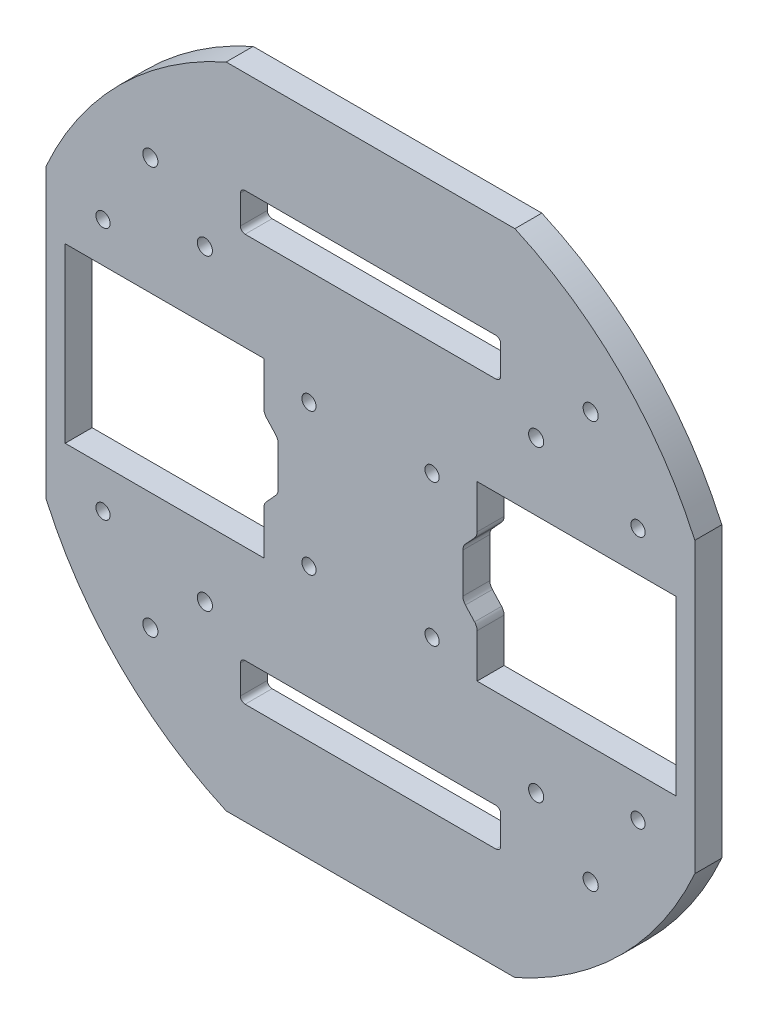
ISO-10303-21;
HEADER;
FILE_DESCRIPTION(('STEP AP214'),'2;1');
FILE_NAME('part.step','',(''),(''),'','','');
FILE_SCHEMA(('AUTOMOTIVE_DESIGN { 1 0 10303 214 1 1 1 1 }'));
ENDSEC;
DATA;
#1=APPLICATION_CONTEXT('core data for automotive mechanical design processes');
#2=APPLICATION_PROTOCOL_DEFINITION('international standard','automotive_design',2000,#1);
#3=PRODUCT_CONTEXT('',#1,'mechanical');
#4=PRODUCT('Part','Part','',(#3));
#5=PRODUCT_RELATED_PRODUCT_CATEGORY('part','',(#4));
#6=PRODUCT_DEFINITION_FORMATION('','',#4);
#7=PRODUCT_DEFINITION_CONTEXT('part definition',#1,'design');
#8=PRODUCT_DEFINITION('design','',#6,#7);
#9=PRODUCT_DEFINITION_SHAPE('','',#8);
#10=(LENGTH_UNIT() NAMED_UNIT(*) SI_UNIT(.MILLI.,.METRE.));
#11=(NAMED_UNIT(*) PLANE_ANGLE_UNIT() SI_UNIT($,.RADIAN.));
#12=(NAMED_UNIT(*) SI_UNIT($,.STERADIAN.) SOLID_ANGLE_UNIT());
#13=UNCERTAINTY_MEASURE_WITH_UNIT(LENGTH_MEASURE(1.E-05),#10,'distance_accuracy_value','');
#14=(GEOMETRIC_REPRESENTATION_CONTEXT(3) GLOBAL_UNCERTAINTY_ASSIGNED_CONTEXT((#13)) GLOBAL_UNIT_ASSIGNED_CONTEXT((#10,
#11,#12)) REPRESENTATION_CONTEXT('',''));
#15=CARTESIAN_POINT('',(0.,0.,0.));
#16=DIRECTION('',(0.,0.,1.));
#17=DIRECTION('',(1.,0.,0.));
#18=AXIS2_PLACEMENT_3D('',#15,#16,#17);
#19=CARTESIAN_POINT('',(0.,0.,5.7));
#20=DIRECTION('',(0.,0.,1.));
#21=DIRECTION('',(1.,0.,0.));
#22=AXIS2_PLACEMENT_3D('',#19,#20,#21);
#23=PLANE('',#22);
#24=CARTESIAN_POINT('',(35.,32.5,5.7));
#25=DIRECTION('',(0.,0.,1.));
#26=DIRECTION('',(1.,0.,0.));
#27=AXIS2_PLACEMENT_3D('',#24,#25,#26);
#28=CIRCLE('',#27,1.6);
#29=CARTESIAN_POINT('',(36.6,32.5,5.7));
#30=VERTEX_POINT('',#29);
#31=EDGE_CURVE('E1010',#30,#30,#28,.T.);
#32=ORIENTED_EDGE('',*,*,#31,.F.);
#33=EDGE_LOOP('',(#32));
#34=FACE_BOUND('',#33,.T.);
#35=CARTESIAN_POINT('',(35.,-32.5,5.7));
#36=DIRECTION('',(0.,0.,1.));
#37=DIRECTION('',(1.,0.,0.));
#38=AXIS2_PLACEMENT_3D('',#35,#36,#37);
#39=CIRCLE('',#38,1.6);
#40=CARTESIAN_POINT('',(36.6,-32.5,5.7));
#41=VERTEX_POINT('',#40);
#42=EDGE_CURVE('E1005',#41,#41,#39,.T.);
#43=ORIENTED_EDGE('',*,*,#42,.F.);
#44=EDGE_LOOP('',(#43));
#45=FACE_BOUND('',#44,.T.);
#46=CARTESIAN_POINT('',(-35.,-32.5,5.7));
#47=DIRECTION('',(0.,0.,1.));
#48=DIRECTION('',(1.,0.,0.));
#49=AXIS2_PLACEMENT_3D('',#46,#47,#48);
#50=CIRCLE('',#49,1.6);
#51=CARTESIAN_POINT('',(-33.4,-32.5,5.7));
#52=VERTEX_POINT('',#51);
#53=EDGE_CURVE('E1000',#52,#52,#50,.T.);
#54=ORIENTED_EDGE('',*,*,#53,.F.);
#55=EDGE_LOOP('',(#54));
#56=FACE_BOUND('',#55,.T.);
#57=CARTESIAN_POINT('',(-35.,32.5,5.7));
#58=DIRECTION('',(0.,0.,1.));
#59=DIRECTION('',(1.,0.,0.));
#60=AXIS2_PLACEMENT_3D('',#57,#58,#59);
#61=CIRCLE('',#60,1.6);
#62=CARTESIAN_POINT('',(-33.4,32.5,5.7));
#63=VERTEX_POINT('',#62);
#64=EDGE_CURVE('E995',#63,#63,#61,.T.);
#65=ORIENTED_EDGE('',*,*,#64,.F.);
#66=EDGE_LOOP('',(#65));
#67=FACE_BOUND('',#66,.T.);
#68=CARTESIAN_POINT('',(46.5182457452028,43.,5.7));
#69=DIRECTION('',(0.,0.,1.));
#70=DIRECTION('',(-1.,0.,0.));
#71=AXIS2_PLACEMENT_3D('',#68,#69,#70);
#72=CIRCLE('',#71,1.6);
#73=CARTESIAN_POINT('',(44.9182457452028,43.,5.7));
#74=VERTEX_POINT('',#73);
#75=EDGE_CURVE('E991',#74,#74,#72,.T.);
#76=ORIENTED_EDGE('',*,*,#75,.F.);
#77=EDGE_LOOP('',(#76));
#78=FACE_BOUND('',#77,.T.);
#79=CARTESIAN_POINT('',(46.5182457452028,-43.,5.7));
#80=DIRECTION('',(0.,0.,1.));
#81=DIRECTION('',(1.,0.,0.));
#82=AXIS2_PLACEMENT_3D('',#79,#80,#81);
#83=CIRCLE('',#82,1.6);
#84=CARTESIAN_POINT('',(48.1182457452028,-43.,5.7));
#85=VERTEX_POINT('',#84);
#86=EDGE_CURVE('E986',#85,#85,#83,.T.);
#87=ORIENTED_EDGE('',*,*,#86,.F.);
#88=EDGE_LOOP('',(#87));
#89=FACE_BOUND('',#88,.T.);
#90=CARTESIAN_POINT('',(-46.5182457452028,-43.,5.7));
#91=DIRECTION('',(0.,0.,1.));
#92=DIRECTION('',(-1.,0.,0.));
#93=AXIS2_PLACEMENT_3D('',#90,#91,#92);
#94=CIRCLE('',#93,1.6);
#95=CARTESIAN_POINT('',(-48.1182457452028,-43.,5.7));
#96=VERTEX_POINT('',#95);
#97=EDGE_CURVE('E980',#96,#96,#94,.T.);
#98=ORIENTED_EDGE('',*,*,#97,.F.);
#99=EDGE_LOOP('',(#98));
#100=FACE_BOUND('',#99,.T.);
#101=CARTESIAN_POINT('',(-46.5182457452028,43.,5.7));
#102=DIRECTION('',(0.,0.,1.));
#103=DIRECTION('',(1.,0.,0.));
#104=AXIS2_PLACEMENT_3D('',#101,#102,#103);
#105=CIRCLE('',#104,1.6);
#106=CARTESIAN_POINT('',(-44.9182457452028,43.,5.7));
#107=VERTEX_POINT('',#106);
#108=EDGE_CURVE('E380',#107,#107,#105,.T.);
#109=ORIENTED_EDGE('',*,*,#108,.F.);
#110=EDGE_LOOP('',(#109));
#111=FACE_BOUND('',#110,.T.);
#112=DIRECTION('',(0.677154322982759,0.735841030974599,0.));
#113=VECTOR('',#112,1.);
#114=CARTESIAN_POINT('',(-22.5182457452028,-8.26,5.7));
#115=LINE('',#114,#113);
#116=CARTESIAN_POINT('',(-21.989927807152,-7.68589450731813,5.7));
#117=VERTEX_POINT('',#116);
#118=CARTESIAN_POINT('',(-20.0465636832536,-5.57410549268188,5.7));
#119=VERTEX_POINT('',#118);
#120=EDGE_CURVE('E494',#117,#119,#115,.T.);
#121=ORIENTED_EDGE('',*,*,#120,.F.);
#122=CARTESIAN_POINT('',(-20.5182457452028,-9.04020315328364,5.7));
#123=DIRECTION('',(0.,0.,1.));
#124=DIRECTION('',(1.,0.,0.));
#125=AXIS2_PLACEMENT_3D('',#122,#123,#124);
#126=CIRCLE('',#125,2.);
#127=CARTESIAN_POINT('',(-22.5182457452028,-9.04020315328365,5.7));
#128=VERTEX_POINT('',#127);
#129=EDGE_CURVE('E954',#117,#128,#126,.T.);
#130=ORIENTED_EDGE('',*,*,#129,.T.);
#131=DIRECTION('',(0.,1.,0.));
#132=VECTOR('',#131,1.);
#133=CARTESIAN_POINT('',(-22.5182457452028,-18.26,5.7));
#134=LINE('',#133,#132);
#135=CARTESIAN_POINT('',(-22.5182457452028,-18.26,5.7));
#136=VERTEX_POINT('',#135);
#137=EDGE_CURVE('E525',#136,#128,#134,.T.);
#138=ORIENTED_EDGE('',*,*,#137,.F.);
#139=DIRECTION('',(1.,0.,0.));
#140=VECTOR('',#139,1.);
#141=CARTESIAN_POINT('',(-64.5182457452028,-18.26,5.7));
#142=LINE('',#141,#140);
#143=CARTESIAN_POINT('',(-64.5182457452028,-18.26,5.7));
#144=VERTEX_POINT('',#143);
#145=EDGE_CURVE('E540',#144,#136,#142,.T.);
#146=ORIENTED_EDGE('',*,*,#145,.F.);
#147=DIRECTION('',(0.,-1.,0.));
#148=VECTOR('',#147,1.);
#149=CARTESIAN_POINT('',(-64.5182457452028,18.26,5.7));
#150=LINE('',#149,#148);
#151=CARTESIAN_POINT('',(-64.5182457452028,18.26,5.7));
#152=VERTEX_POINT('',#151);
#153=EDGE_CURVE('E546',#152,#144,#150,.T.);
#154=ORIENTED_EDGE('',*,*,#153,.F.);
#155=DIRECTION('',(-1.,0.,0.));
#156=VECTOR('',#155,1.);
#157=CARTESIAN_POINT('',(-64.5182457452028,18.26,5.7));
#158=LINE('',#157,#156);
#159=CARTESIAN_POINT('',(-22.5182457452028,18.26,5.7));
#160=VERTEX_POINT('',#159);
#161=EDGE_CURVE('E969',#160,#152,#158,.T.);
#162=ORIENTED_EDGE('',*,*,#161,.F.);
#163=DIRECTION('',(0.,1.,0.));
#164=VECTOR('',#163,1.);
#165=CARTESIAN_POINT('',(-22.5182457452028,18.26,5.7));
#166=LINE('',#165,#164);
#167=CARTESIAN_POINT('',(-22.5182457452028,9.04020315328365,5.7));
#168=VERTEX_POINT('',#167);
#169=EDGE_CURVE('E889',#168,#160,#166,.T.);
#170=ORIENTED_EDGE('',*,*,#169,.F.);
#171=CARTESIAN_POINT('',(-20.5182457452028,9.04020315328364,5.7));
#172=DIRECTION('',(0.,0.,1.));
#173=DIRECTION('',(1.,0.,0.));
#174=AXIS2_PLACEMENT_3D('',#171,#172,#173);
#175=CIRCLE('',#174,2.);
#176=CARTESIAN_POINT('',(-21.989927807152,7.68589450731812,5.7));
#177=VERTEX_POINT('',#176);
#178=EDGE_CURVE('E950',#168,#177,#175,.T.);
#179=ORIENTED_EDGE('',*,*,#178,.T.);
#180=DIRECTION('',(-0.677154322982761,0.735841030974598,0.));
#181=VECTOR('',#180,1.);
#182=CARTESIAN_POINT('',(-22.5182457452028,8.26,5.7));
#183=LINE('',#182,#181);
#184=CARTESIAN_POINT('',(-20.0465636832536,5.57410549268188,5.7));
#185=VERTEX_POINT('',#184);
#186=EDGE_CURVE('E485',#185,#177,#183,.T.);
#187=ORIENTED_EDGE('',*,*,#186,.F.);
#188=CARTESIAN_POINT('',(-21.5182457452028,4.21979684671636,5.7));
#189=DIRECTION('',(0.,0.,1.));
#190=DIRECTION('',(1.,0.,0.));
#191=AXIS2_PLACEMENT_3D('',#188,#189,#190);
#192=CIRCLE('',#191,2.);
#193=CARTESIAN_POINT('',(-19.5182457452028,4.21979684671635,5.7));
#194=VERTEX_POINT('',#193);
#195=EDGE_CURVE('E49',#185,#194,#192,.F.);
#196=ORIENTED_EDGE('',*,*,#195,.T.);
#197=DIRECTION('',(0.,1.,0.));
#198=VECTOR('',#197,1.);
#199=CARTESIAN_POINT('',(-19.5182457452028,5.,5.7));
#200=LINE('',#199,#198);
#201=CARTESIAN_POINT('',(-19.5182457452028,-4.21979684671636,5.7));
#202=VERTEX_POINT('',#201);
#203=EDGE_CURVE('E483',#202,#194,#200,.T.);
#204=ORIENTED_EDGE('',*,*,#203,.F.);
#205=CARTESIAN_POINT('',(-21.5182457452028,-4.21979684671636,5.7));
#206=DIRECTION('',(0.,0.,1.));
#207=DIRECTION('',(1.,0.,0.));
#208=AXIS2_PLACEMENT_3D('',#205,#206,#207);
#209=CIRCLE('',#208,2.);
#210=EDGE_CURVE('E470',#202,#119,#209,.F.);
#211=ORIENTED_EDGE('',*,*,#210,.T.);
#212=EDGE_LOOP('',(#121,#130,#138,#146,#154,#162,#170,#179,#187,#196,#204,#211));
#213=FACE_BOUND('',#212,.T.);
#214=CARTESIAN_POINT('',(56.5182457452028,-26.7,5.7));
#215=DIRECTION('',(0.,0.,-1.));
#216=DIRECTION('',(-1.,0.,0.));
#217=AXIS2_PLACEMENT_3D('',#214,#215,#216);
#218=CIRCLE('',#217,1.5);
#219=CARTESIAN_POINT('',(55.0182457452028,-26.7,5.7));
#220=VERTEX_POINT('',#219);
#221=EDGE_CURVE('E551',#220,#220,#218,.T.);
#222=ORIENTED_EDGE('',*,*,#221,.T.);
#223=EDGE_LOOP('',(#222));
#224=FACE_BOUND('',#223,.T.);
#225=CARTESIAN_POINT('',(56.5182457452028,26.7,5.7));
#226=DIRECTION('',(0.,0.,-1.));
#227=DIRECTION('',(-1.,0.,0.));
#228=AXIS2_PLACEMENT_3D('',#225,#226,#227);
#229=CIRCLE('',#228,1.5);
#230=CARTESIAN_POINT('',(55.0182457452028,26.7,5.7));
#231=VERTEX_POINT('',#230);
#232=EDGE_CURVE('E561',#231,#231,#229,.T.);
#233=ORIENTED_EDGE('',*,*,#232,.T.);
#234=EDGE_LOOP('',(#233));
#235=FACE_BOUND('',#234,.T.);
#236=CARTESIAN_POINT('',(-56.5182457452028,-26.7,5.7));
#237=DIRECTION('',(0.,0.,1.));
#238=DIRECTION('',(1.,0.,0.));
#239=AXIS2_PLACEMENT_3D('',#236,#237,#238);
#240=CIRCLE('',#239,1.5);
#241=CARTESIAN_POINT('',(-55.0182457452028,-26.7,5.7));
#242=VERTEX_POINT('',#241);
#243=EDGE_CURVE('E582',#242,#242,#240,.T.);
#244=ORIENTED_EDGE('',*,*,#243,.F.);
#245=EDGE_LOOP('',(#244));
#246=FACE_BOUND('',#245,.T.);
#247=CARTESIAN_POINT('',(-56.5182457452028,26.7,5.7));
#248=DIRECTION('',(0.,0.,1.));
#249=DIRECTION('',(1.,0.,0.));
#250=AXIS2_PLACEMENT_3D('',#247,#248,#249);
#251=CIRCLE('',#250,1.5);
#252=CARTESIAN_POINT('',(-55.0182457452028,26.7,5.7));
#253=VERTEX_POINT('',#252);
#254=EDGE_CURVE('E581',#253,#253,#251,.T.);
#255=ORIENTED_EDGE('',*,*,#254,.F.);
#256=EDGE_LOOP('',(#255));
#257=FACE_BOUND('',#256,.T.);
#258=CARTESIAN_POINT('',(13.,15.,5.7));
#259=DIRECTION('',(0.,0.,-1.));
#260=DIRECTION('',(1.,0.,0.));
#261=AXIS2_PLACEMENT_3D('',#258,#259,#260);
#262=CIRCLE('',#261,1.5);
#263=CARTESIAN_POINT('',(14.5,15.,5.7));
#264=VERTEX_POINT('',#263);
#265=EDGE_CURVE('E602',#264,#264,#262,.T.);
#266=ORIENTED_EDGE('',*,*,#265,.T.);
#267=EDGE_LOOP('',(#266));
#268=FACE_BOUND('',#267,.T.);
#269=CARTESIAN_POINT('',(-13.,15.,5.7));
#270=DIRECTION('',(0.,0.,-1.));
#271=DIRECTION('',(1.,0.,0.));
#272=AXIS2_PLACEMENT_3D('',#269,#270,#271);
#273=CIRCLE('',#272,1.5);
#274=CARTESIAN_POINT('',(-11.5,15.,5.7));
#275=VERTEX_POINT('',#274);
#276=EDGE_CURVE('E613',#275,#275,#273,.T.);
#277=ORIENTED_EDGE('',*,*,#276,.T.);
#278=EDGE_LOOP('',(#277));
#279=FACE_BOUND('',#278,.T.);
#280=DIRECTION('',(0.,1.,0.));
#281=VECTOR('',#280,1.);
#282=CARTESIAN_POINT('',(27.5,-39.,5.7));
#283=LINE('',#282,#281);
#284=CARTESIAN_POINT('',(27.5,-46.,5.7));
#285=VERTEX_POINT('',#284);
#286=CARTESIAN_POINT('',(27.5,-40.,5.7));
#287=VERTEX_POINT('',#286);
#288=EDGE_CURVE('E612',#285,#287,#283,.T.);
#289=ORIENTED_EDGE('',*,*,#288,.F.);
#290=CARTESIAN_POINT('',(26.5,-46.,5.7));
#291=DIRECTION('',(0.,0.,1.));
#292=DIRECTION('',(1.,0.,0.));
#293=AXIS2_PLACEMENT_3D('',#290,#291,#292);
#294=CIRCLE('',#293,1.);
#295=CARTESIAN_POINT('',(26.5,-47.,5.7));
#296=VERTEX_POINT('',#295);
#297=EDGE_CURVE('E1722',#285,#296,#294,.F.);
#298=ORIENTED_EDGE('',*,*,#297,.T.);
#299=DIRECTION('',(1.,0.,0.));
#300=VECTOR('',#299,1.);
#301=CARTESIAN_POINT('',(-27.5,-47.,5.7));
#302=LINE('',#301,#300);
#303=CARTESIAN_POINT('',(-26.5,-47.,5.7));
#304=VERTEX_POINT('',#303);
#305=EDGE_CURVE('E622',#304,#296,#302,.T.);
#306=ORIENTED_EDGE('',*,*,#305,.F.);
#307=CARTESIAN_POINT('',(-26.5,-46.,5.7));
#308=DIRECTION('',(0.,0.,1.));
#309=DIRECTION('',(1.,0.,0.));
#310=AXIS2_PLACEMENT_3D('',#307,#308,#309);
#311=CIRCLE('',#310,1.);
#312=CARTESIAN_POINT('',(-27.5,-46.,5.7));
#313=VERTEX_POINT('',#312);
#314=EDGE_CURVE('E1707',#304,#313,#311,.F.);
#315=ORIENTED_EDGE('',*,*,#314,.T.);
#316=DIRECTION('',(0.,-1.,0.));
#317=VECTOR('',#316,1.);
#318=CARTESIAN_POINT('',(-27.5,-39.,5.7));
#319=LINE('',#318,#317);
#320=CARTESIAN_POINT('',(-27.5,-40.,5.7));
#321=VERTEX_POINT('',#320);
#322=EDGE_CURVE('E647',#321,#313,#319,.T.);
#323=ORIENTED_EDGE('',*,*,#322,.F.);
#324=CARTESIAN_POINT('',(-26.5,-40.,5.7));
#325=DIRECTION('',(0.,0.,1.));
#326=DIRECTION('',(1.,0.,0.));
#327=AXIS2_PLACEMENT_3D('',#324,#325,#326);
#328=CIRCLE('',#327,1.);
#329=CARTESIAN_POINT('',(-26.5,-39.,5.7));
#330=VERTEX_POINT('',#329);
#331=EDGE_CURVE('E1712',#321,#330,#328,.F.);
#332=ORIENTED_EDGE('',*,*,#331,.T.);
#333=DIRECTION('',(-1.,0.,0.));
#334=VECTOR('',#333,1.);
#335=CARTESIAN_POINT('',(-27.5,-39.,5.7));
#336=LINE('',#335,#334);
#337=CARTESIAN_POINT('',(26.5,-39.,5.7));
#338=VERTEX_POINT('',#337);
#339=EDGE_CURVE('E636',#338,#330,#336,.T.);
#340=ORIENTED_EDGE('',*,*,#339,.F.);
#341=CARTESIAN_POINT('',(26.5,-40.,5.7));
#342=DIRECTION('',(0.,0.,1.));
#343=DIRECTION('',(1.,0.,0.));
#344=AXIS2_PLACEMENT_3D('',#341,#342,#343);
#345=CIRCLE('',#344,1.);
#346=EDGE_CURVE('E1717',#338,#287,#345,.F.);
#347=ORIENTED_EDGE('',*,*,#346,.T.);
#348=EDGE_LOOP('',(#289,#298,#306,#315,#323,#332,#340,#347));
#349=FACE_BOUND('',#348,.T.);
#350=CARTESIAN_POINT('',(13.,-15.,5.7));
#351=DIRECTION('',(0.,0.,1.));
#352=DIRECTION('',(1.,0.,0.));
#353=AXIS2_PLACEMENT_3D('',#350,#351,#352);
#354=CIRCLE('',#353,1.5);
#355=CARTESIAN_POINT('',(14.5,-15.,5.7));
#356=VERTEX_POINT('',#355);
#357=EDGE_CURVE('E631',#356,#356,#354,.T.);
#358=ORIENTED_EDGE('',*,*,#357,.F.);
#359=EDGE_LOOP('',(#358));
#360=FACE_BOUND('',#359,.T.);
#361=CARTESIAN_POINT('',(-13.,-15.,5.7));
#362=DIRECTION('',(0.,0.,1.));
#363=DIRECTION('',(1.,0.,0.));
#364=AXIS2_PLACEMENT_3D('',#361,#362,#363);
#365=CIRCLE('',#364,1.5);
#366=CARTESIAN_POINT('',(-11.5,-15.,5.7));
#367=VERTEX_POINT('',#366);
#368=EDGE_CURVE('E652',#367,#367,#365,.T.);
#369=ORIENTED_EDGE('',*,*,#368,.F.);
#370=EDGE_LOOP('',(#369));
#371=FACE_BOUND('',#370,.T.);
#372=DIRECTION('',(0.,-1.,0.));
#373=VECTOR('',#372,1.);
#374=CARTESIAN_POINT('',(68.5182457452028,-30.5,5.7));
#375=LINE('',#374,#373);
#376=CARTESIAN_POINT('',(68.5182457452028,30.5,5.7));
#377=VERTEX_POINT('',#376);
#378=CARTESIAN_POINT('',(68.5182457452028,-30.5,5.7));
#379=VERTEX_POINT('',#378);
#380=EDGE_CURVE('E671',#377,#379,#375,.T.);
#381=ORIENTED_EDGE('',*,*,#380,.F.);
#382=CARTESIAN_POINT('',(0.,0.,5.7));
#383=DIRECTION('',(0.,0.,1.));
#384=DIRECTION('',(1.,0.,0.));
#385=AXIS2_PLACEMENT_3D('',#382,#383,#384);
#386=CIRCLE('',#385,75.);
#387=CARTESIAN_POINT('',(30.4999999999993,68.5182457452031,5.7));
#388=VERTEX_POINT('',#387);
#389=EDGE_CURVE('E777',#377,#388,#386,.T.);
#390=ORIENTED_EDGE('',*,*,#389,.T.);
#391=DIRECTION('',(1.,0.,0.));
#392=VECTOR('',#391,1.);
#393=CARTESIAN_POINT('',(30.4999999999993,68.5182457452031,5.7));
#394=LINE('',#393,#392);
#395=CARTESIAN_POINT('',(-30.5000000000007,68.5182457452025,5.7));
#396=VERTEX_POINT('',#395);
#397=EDGE_CURVE('E685',#396,#388,#394,.T.);
#398=ORIENTED_EDGE('',*,*,#397,.F.);
#399=CARTESIAN_POINT('',(-68.5182457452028,30.5,5.7));
#400=VERTEX_POINT('',#399);
#401=EDGE_CURVE('E704',#396,#400,#386,.T.);
#402=ORIENTED_EDGE('',*,*,#401,.T.);
#403=DIRECTION('',(0.,1.,0.));
#404=VECTOR('',#403,1.);
#405=CARTESIAN_POINT('',(-68.5182457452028,30.5,5.7));
#406=LINE('',#405,#404);
#407=CARTESIAN_POINT('',(-68.5182457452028,-30.5,5.7));
#408=VERTEX_POINT('',#407);
#409=EDGE_CURVE('E724',#408,#400,#406,.T.);
#410=ORIENTED_EDGE('',*,*,#409,.F.);
#411=CARTESIAN_POINT('',(-30.4999999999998,-68.5182457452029,5.7));
#412=VERTEX_POINT('',#411);
#413=EDGE_CURVE('E696',#408,#412,#386,.T.);
#414=ORIENTED_EDGE('',*,*,#413,.T.);
#415=DIRECTION('',(-1.,0.,0.));
#416=VECTOR('',#415,1.);
#417=CARTESIAN_POINT('',(-30.4999999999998,-68.5182457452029,5.7));
#418=LINE('',#417,#416);
#419=CARTESIAN_POINT('',(30.5000000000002,-68.5182457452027,5.7));
#420=VERTEX_POINT('',#419);
#421=EDGE_CURVE('E679',#420,#412,#418,.T.);
#422=ORIENTED_EDGE('',*,*,#421,.F.);
#423=EDGE_CURVE('E703',#420,#379,#386,.T.);
#424=ORIENTED_EDGE('',*,*,#423,.T.);
#425=EDGE_LOOP('',(#381,#390,#398,#402,#410,#414,#422,#424));
#426=FACE_BOUND('',#425,.T.);
#427=DIRECTION('',(0.,1.,0.));
#428=VECTOR('',#427,1.);
#429=CARTESIAN_POINT('',(-27.5,39.,5.7));
#430=LINE('',#429,#428);
#431=CARTESIAN_POINT('',(-27.5,40.,5.7));
#432=VERTEX_POINT('',#431);
#433=CARTESIAN_POINT('',(-27.5,46.,5.7));
#434=VERTEX_POINT('',#433);
#435=EDGE_CURVE('E1643',#432,#434,#430,.T.);
#436=ORIENTED_EDGE('',*,*,#435,.T.);
#437=CARTESIAN_POINT('',(-26.5,46.,5.7));
#438=DIRECTION('',(0.,0.,1.));
#439=DIRECTION('',(1.,0.,0.));
#440=AXIS2_PLACEMENT_3D('',#437,#438,#439);
#441=CIRCLE('',#440,1.);
#442=CARTESIAN_POINT('',(-26.5,47.,5.7));
#443=VERTEX_POINT('',#442);
#444=EDGE_CURVE('E1660',#434,#443,#441,.F.);
#445=ORIENTED_EDGE('',*,*,#444,.T.);
#446=DIRECTION('',(1.,0.,0.));
#447=VECTOR('',#446,1.);
#448=CARTESIAN_POINT('',(-27.5,47.,5.7));
#449=LINE('',#448,#447);
#450=CARTESIAN_POINT('',(26.5,47.,5.7));
#451=VERTEX_POINT('',#450);
#452=EDGE_CURVE('E1651',#443,#451,#449,.T.);
#453=ORIENTED_EDGE('',*,*,#452,.T.);
#454=CARTESIAN_POINT('',(26.5,46.,5.7));
#455=DIRECTION('',(0.,0.,1.));
#456=DIRECTION('',(1.,0.,0.));
#457=AXIS2_PLACEMENT_3D('',#454,#455,#456);
#458=CIRCLE('',#457,1.);
#459=CARTESIAN_POINT('',(27.5,46.,5.7));
#460=VERTEX_POINT('',#459);
#461=EDGE_CURVE('E1653',#451,#460,#458,.F.);
#462=ORIENTED_EDGE('',*,*,#461,.T.);
#463=DIRECTION('',(0.,-1.,0.));
#464=VECTOR('',#463,1.);
#465=CARTESIAN_POINT('',(27.5,39.,5.7));
#466=LINE('',#465,#464);
#467=CARTESIAN_POINT('',(27.5,40.,5.7));
#468=VERTEX_POINT('',#467);
#469=EDGE_CURVE('E590',#460,#468,#466,.T.);
#470=ORIENTED_EDGE('',*,*,#469,.T.);
#471=CARTESIAN_POINT('',(26.5,40.,5.7));
#472=DIRECTION('',(0.,0.,1.));
#473=DIRECTION('',(1.,0.,0.));
#474=AXIS2_PLACEMENT_3D('',#471,#472,#473);
#475=CIRCLE('',#474,1.);
#476=CARTESIAN_POINT('',(26.5,39.,5.7));
#477=VERTEX_POINT('',#476);
#478=EDGE_CURVE('E1644',#468,#477,#475,.F.);
#479=ORIENTED_EDGE('',*,*,#478,.T.);
#480=DIRECTION('',(-1.,0.,0.));
#481=VECTOR('',#480,1.);
#482=CARTESIAN_POINT('',(-27.5,39.,5.7));
#483=LINE('',#482,#481);
#484=CARTESIAN_POINT('',(-26.5,39.,5.7));
#485=VERTEX_POINT('',#484);
#486=EDGE_CURVE('E1640',#477,#485,#483,.T.);
#487=ORIENTED_EDGE('',*,*,#486,.T.);
#488=CARTESIAN_POINT('',(-26.5,40.,5.7));
#489=DIRECTION('',(0.,0.,1.));
#490=DIRECTION('',(1.,0.,0.));
#491=AXIS2_PLACEMENT_3D('',#488,#489,#490);
#492=CIRCLE('',#491,1.);
#493=EDGE_CURVE('E956',#485,#432,#492,.F.);
#494=ORIENTED_EDGE('',*,*,#493,.T.);
#495=EDGE_LOOP('',(#436,#445,#453,#462,#470,#479,#487,#494));
#496=FACE_BOUND('',#495,.T.);
#497=DIRECTION('',(0.,1.,0.));
#498=VECTOR('',#497,1.);
#499=CARTESIAN_POINT('',(22.5182457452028,-18.26,5.7));
#500=LINE('',#499,#498);
#501=CARTESIAN_POINT('',(22.5182457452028,-18.26,5.7));
#502=VERTEX_POINT('',#501);
#503=CARTESIAN_POINT('',(22.5182457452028,-9.04020315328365,5.7));
#504=VERTEX_POINT('',#503);
#505=EDGE_CURVE('E366',#502,#504,#500,.T.);
#506=ORIENTED_EDGE('',*,*,#505,.T.);
#507=CARTESIAN_POINT('',(20.5182457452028,-9.04020315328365,5.7));
#508=DIRECTION('',(0.,0.,1.));
#509=DIRECTION('',(1.,0.,0.));
#510=AXIS2_PLACEMENT_3D('',#507,#508,#509);
#511=CIRCLE('',#510,2.);
#512=CARTESIAN_POINT('',(21.989927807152,-7.68589450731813,5.7));
#513=VERTEX_POINT('',#512);
#514=EDGE_CURVE('E410',#504,#513,#511,.T.);
#515=ORIENTED_EDGE('',*,*,#514,.T.);
#516=DIRECTION('',(-0.677154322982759,0.735841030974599,0.));
#517=VECTOR('',#516,1.);
#518=CARTESIAN_POINT('',(22.5182457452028,-8.26,5.7));
#519=LINE('',#518,#517);
#520=CARTESIAN_POINT('',(20.0465636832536,-5.57410549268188,5.7));
#521=VERTEX_POINT('',#520);
#522=EDGE_CURVE('E373',#513,#521,#519,.T.);
#523=ORIENTED_EDGE('',*,*,#522,.T.);
#524=CARTESIAN_POINT('',(21.5182457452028,-4.21979684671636,5.7));
#525=DIRECTION('',(0.,0.,1.));
#526=DIRECTION('',(1.,0.,0.));
#527=AXIS2_PLACEMENT_3D('',#524,#525,#526);
#528=CIRCLE('',#527,2.);
#529=CARTESIAN_POINT('',(19.5182457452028,-4.21979684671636,5.7));
#530=VERTEX_POINT('',#529);
#531=EDGE_CURVE('E461',#521,#530,#528,.F.);
#532=ORIENTED_EDGE('',*,*,#531,.T.);
#533=DIRECTION('',(0.,1.,0.));
#534=VECTOR('',#533,1.);
#535=CARTESIAN_POINT('',(19.5182457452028,5.,5.7));
#536=LINE('',#535,#534);
#537=CARTESIAN_POINT('',(19.5182457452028,4.21979684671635,5.7));
#538=VERTEX_POINT('',#537);
#539=EDGE_CURVE('E377',#530,#538,#536,.T.);
#540=ORIENTED_EDGE('',*,*,#539,.T.);
#541=CARTESIAN_POINT('',(21.5182457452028,4.21979684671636,5.7));
#542=DIRECTION('',(0.,0.,1.));
#543=DIRECTION('',(1.,0.,0.));
#544=AXIS2_PLACEMENT_3D('',#541,#542,#543);
#545=CIRCLE('',#544,2.);
#546=CARTESIAN_POINT('',(20.0465636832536,5.57410549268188,5.7));
#547=VERTEX_POINT('',#546);
#548=EDGE_CURVE('E466',#538,#547,#545,.F.);
#549=ORIENTED_EDGE('',*,*,#548,.T.);
#550=DIRECTION('',(0.677154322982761,0.735841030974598,0.));
#551=VECTOR('',#550,1.);
#552=CARTESIAN_POINT('',(22.5182457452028,8.26,5.7));
#553=LINE('',#552,#551);
#554=CARTESIAN_POINT('',(21.989927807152,7.68589450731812,5.7));
#555=VERTEX_POINT('',#554);
#556=EDGE_CURVE('E922',#547,#555,#553,.T.);
#557=ORIENTED_EDGE('',*,*,#556,.T.);
#558=CARTESIAN_POINT('',(20.5182457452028,9.04020315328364,5.7));
#559=DIRECTION('',(0.,0.,1.));
#560=DIRECTION('',(1.,0.,0.));
#561=AXIS2_PLACEMENT_3D('',#558,#559,#560);
#562=CIRCLE('',#561,2.);
#563=CARTESIAN_POINT('',(22.5182457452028,9.04020315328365,5.7));
#564=VERTEX_POINT('',#563);
#565=EDGE_CURVE('E416',#555,#564,#562,.T.);
#566=ORIENTED_EDGE('',*,*,#565,.T.);
#567=DIRECTION('',(0.,1.,0.));
#568=VECTOR('',#567,1.);
#569=CARTESIAN_POINT('',(22.5182457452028,18.26,5.7));
#570=LINE('',#569,#568);
#571=CARTESIAN_POINT('',(22.5182457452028,18.26,5.7));
#572=VERTEX_POINT('',#571);
#573=EDGE_CURVE('E930',#564,#572,#570,.T.);
#574=ORIENTED_EDGE('',*,*,#573,.T.);
#575=DIRECTION('',(1.,0.,0.));
#576=VECTOR('',#575,1.);
#577=CARTESIAN_POINT('',(64.5182457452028,18.26,5.7));
#578=LINE('',#577,#576);
#579=CARTESIAN_POINT('',(64.5182457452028,18.26,5.7));
#580=VERTEX_POINT('',#579);
#581=EDGE_CURVE('E933',#572,#580,#578,.T.);
#582=ORIENTED_EDGE('',*,*,#581,.T.);
#583=DIRECTION('',(0.,-1.,0.));
#584=VECTOR('',#583,1.);
#585=CARTESIAN_POINT('',(64.5182457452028,18.26,5.7));
#586=LINE('',#585,#584);
#587=CARTESIAN_POINT('',(64.5182457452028,-18.26,5.7));
#588=VERTEX_POINT('',#587);
#589=EDGE_CURVE('E937',#580,#588,#586,.T.);
#590=ORIENTED_EDGE('',*,*,#589,.T.);
#591=DIRECTION('',(-1.,0.,0.));
#592=VECTOR('',#591,1.);
#593=CARTESIAN_POINT('',(64.5182457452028,-18.26,5.7));
#594=LINE('',#593,#592);
#595=EDGE_CURVE('E398',#588,#502,#594,.T.);
#596=ORIENTED_EDGE('',*,*,#595,.T.);
#597=EDGE_LOOP('',(#506,#515,#523,#532,#540,#549,#557,#566,#574,#582,#590,#596));
#598=FACE_BOUND('',#597,.T.);
#599=ADVANCED_FACE('F41',(#34,#45,#56,#67,#78,#89,#100,#111,#213,#224,#235,#246,#257,#268,#279,
#349,#360,#371,#426,#496,#598),#23,.T.);
#600=CARTESIAN_POINT('',(0.,0.,0.));
#601=DIRECTION('',(0.,0.,1.));
#602=DIRECTION('',(1.,0.,0.));
#603=AXIS2_PLACEMENT_3D('',#600,#601,#602);
#604=PLANE('',#603);
#605=CARTESIAN_POINT('',(35.,32.5,0.));
#606=DIRECTION('',(0.,0.,1.));
#607=DIRECTION('',(1.,0.,0.));
#608=AXIS2_PLACEMENT_3D('',#605,#606,#607);
#609=CIRCLE('',#608,1.6);
#610=CARTESIAN_POINT('',(36.6,32.5,0.));
#611=VERTEX_POINT('',#610);
#612=EDGE_CURVE('E998',#611,#611,#609,.T.);
#613=ORIENTED_EDGE('',*,*,#612,.T.);
#614=EDGE_LOOP('',(#613));
#615=FACE_BOUND('',#614,.T.);
#616=CARTESIAN_POINT('',(35.,-32.5,0.));
#617=DIRECTION('',(0.,0.,1.));
#618=DIRECTION('',(1.,0.,0.));
#619=AXIS2_PLACEMENT_3D('',#616,#617,#618);
#620=CIRCLE('',#619,1.6);
#621=CARTESIAN_POINT('',(36.6,-32.5,0.));
#622=VERTEX_POINT('',#621);
#623=EDGE_CURVE('E1008',#622,#622,#620,.T.);
#624=ORIENTED_EDGE('',*,*,#623,.T.);
#625=EDGE_LOOP('',(#624));
#626=FACE_BOUND('',#625,.T.);
#627=CARTESIAN_POINT('',(-35.,-32.5,0.));
#628=DIRECTION('',(0.,0.,1.));
#629=DIRECTION('',(1.,0.,0.));
#630=AXIS2_PLACEMENT_3D('',#627,#628,#629);
#631=CIRCLE('',#630,1.6);
#632=CARTESIAN_POINT('',(-33.4,-32.5,0.));
#633=VERTEX_POINT('',#632);
#634=EDGE_CURVE('E1003',#633,#633,#631,.T.);
#635=ORIENTED_EDGE('',*,*,#634,.T.);
#636=EDGE_LOOP('',(#635));
#637=FACE_BOUND('',#636,.T.);
#638=CARTESIAN_POINT('',(-35.,32.5,0.));
#639=DIRECTION('',(0.,0.,1.));
#640=DIRECTION('',(1.,0.,0.));
#641=AXIS2_PLACEMENT_3D('',#638,#639,#640);
#642=CIRCLE('',#641,1.6);
#643=CARTESIAN_POINT('',(-33.4,32.5,0.));
#644=VERTEX_POINT('',#643);
#645=EDGE_CURVE('E984',#644,#644,#642,.T.);
#646=ORIENTED_EDGE('',*,*,#645,.T.);
#647=EDGE_LOOP('',(#646));
#648=FACE_BOUND('',#647,.T.);
#649=CARTESIAN_POINT('',(46.5182457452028,43.,0.));
#650=DIRECTION('',(0.,0.,1.));
#651=DIRECTION('',(-1.,0.,0.));
#652=AXIS2_PLACEMENT_3D('',#649,#650,#651);
#653=CIRCLE('',#652,1.6);
#654=CARTESIAN_POINT('',(44.9182457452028,43.,0.));
#655=VERTEX_POINT('',#654);
#656=EDGE_CURVE('E979',#655,#655,#653,.T.);
#657=ORIENTED_EDGE('',*,*,#656,.T.);
#658=EDGE_LOOP('',(#657));
#659=FACE_BOUND('',#658,.T.);
#660=CARTESIAN_POINT('',(46.5182457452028,-43.,0.));
#661=DIRECTION('',(0.,0.,1.));
#662=DIRECTION('',(1.,0.,0.));
#663=AXIS2_PLACEMENT_3D('',#660,#661,#662);
#664=CIRCLE('',#663,1.6);
#665=CARTESIAN_POINT('',(48.1182457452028,-43.,0.));
#666=VERTEX_POINT('',#665);
#667=EDGE_CURVE('E989',#666,#666,#664,.T.);
#668=ORIENTED_EDGE('',*,*,#667,.T.);
#669=EDGE_LOOP('',(#668));
#670=FACE_BOUND('',#669,.T.);
#671=CARTESIAN_POINT('',(-46.5182457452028,-43.,0.));
#672=DIRECTION('',(0.,0.,1.));
#673=DIRECTION('',(-1.,0.,0.));
#674=AXIS2_PLACEMENT_3D('',#671,#672,#673);
#675=CIRCLE('',#674,1.6);
#676=CARTESIAN_POINT('',(-48.1182457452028,-43.,0.));
#677=VERTEX_POINT('',#676);
#678=EDGE_CURVE('E983',#677,#677,#675,.T.);
#679=ORIENTED_EDGE('',*,*,#678,.T.);
#680=EDGE_LOOP('',(#679));
#681=FACE_BOUND('',#680,.T.);
#682=CARTESIAN_POINT('',(-46.5182457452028,43.,0.));
#683=DIRECTION('',(0.,0.,1.));
#684=DIRECTION('',(1.,0.,0.));
#685=AXIS2_PLACEMENT_3D('',#682,#683,#684);
#686=CIRCLE('',#685,1.6);
#687=CARTESIAN_POINT('',(-44.9182457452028,43.,0.));
#688=VERTEX_POINT('',#687);
#689=EDGE_CURVE('E399',#688,#688,#686,.T.);
#690=ORIENTED_EDGE('',*,*,#689,.T.);
#691=EDGE_LOOP('',(#690));
#692=FACE_BOUND('',#691,.T.);
#693=DIRECTION('',(0.,-1.,0.));
#694=VECTOR('',#693,1.);
#695=CARTESIAN_POINT('',(27.5,39.,0.));
#696=LINE('',#695,#694);
#697=CARTESIAN_POINT('',(27.5,46.,0.));
#698=VERTEX_POINT('',#697);
#699=CARTESIAN_POINT('',(27.5,40.,0.));
#700=VERTEX_POINT('',#699);
#701=EDGE_CURVE('E595',#698,#700,#696,.T.);
#702=ORIENTED_EDGE('',*,*,#701,.F.);
#703=CARTESIAN_POINT('',(26.5,46.,0.));
#704=DIRECTION('',(0.,0.,1.));
#705=DIRECTION('',(1.,0.,0.));
#706=AXIS2_PLACEMENT_3D('',#703,#704,#705);
#707=CIRCLE('',#706,1.);
#708=CARTESIAN_POINT('',(26.5,47.,0.));
#709=VERTEX_POINT('',#708);
#710=EDGE_CURVE('E1655',#698,#709,#707,.T.);
#711=ORIENTED_EDGE('',*,*,#710,.T.);
#712=DIRECTION('',(1.,0.,0.));
#713=VECTOR('',#712,1.);
#714=CARTESIAN_POINT('',(-27.5,47.,0.));
#715=LINE('',#714,#713);
#716=CARTESIAN_POINT('',(-26.5,47.,0.));
#717=VERTEX_POINT('',#716);
#718=EDGE_CURVE('E1675',#717,#709,#715,.T.);
#719=ORIENTED_EDGE('',*,*,#718,.F.);
#720=CARTESIAN_POINT('',(-26.5,46.,0.));
#721=DIRECTION('',(0.,0.,1.));
#722=DIRECTION('',(1.,0.,0.));
#723=AXIS2_PLACEMENT_3D('',#720,#721,#722);
#724=CIRCLE('',#723,1.);
#725=CARTESIAN_POINT('',(-27.5,46.,0.));
#726=VERTEX_POINT('',#725);
#727=EDGE_CURVE('E1639',#717,#726,#724,.T.);
#728=ORIENTED_EDGE('',*,*,#727,.T.);
#729=DIRECTION('',(0.,1.,0.));
#730=VECTOR('',#729,1.);
#731=CARTESIAN_POINT('',(-27.5,39.,0.));
#732=LINE('',#731,#730);
#733=CARTESIAN_POINT('',(-27.5,40.,0.));
#734=VERTEX_POINT('',#733);
#735=EDGE_CURVE('E1673',#734,#726,#732,.T.);
#736=ORIENTED_EDGE('',*,*,#735,.F.);
#737=CARTESIAN_POINT('',(-26.5,40.,0.));
#738=DIRECTION('',(0.,0.,1.));
#739=DIRECTION('',(1.,0.,0.));
#740=AXIS2_PLACEMENT_3D('',#737,#738,#739);
#741=CIRCLE('',#740,1.);
#742=CARTESIAN_POINT('',(-26.5,39.,0.));
#743=VERTEX_POINT('',#742);
#744=EDGE_CURVE('E951',#734,#743,#741,.T.);
#745=ORIENTED_EDGE('',*,*,#744,.T.);
#746=DIRECTION('',(-1.,0.,0.));
#747=VECTOR('',#746,1.);
#748=CARTESIAN_POINT('',(-27.5,39.,0.));
#749=LINE('',#748,#747);
#750=CARTESIAN_POINT('',(26.5,39.,0.));
#751=VERTEX_POINT('',#750);
#752=EDGE_CURVE('E609',#751,#743,#749,.T.);
#753=ORIENTED_EDGE('',*,*,#752,.F.);
#754=CARTESIAN_POINT('',(26.5,40.,0.));
#755=DIRECTION('',(0.,0.,1.));
#756=DIRECTION('',(1.,0.,0.));
#757=AXIS2_PLACEMENT_3D('',#754,#755,#756);
#758=CIRCLE('',#757,1.);
#759=EDGE_CURVE('E1646',#751,#700,#758,.T.);
#760=ORIENTED_EDGE('',*,*,#759,.T.);
#761=EDGE_LOOP('',(#702,#711,#719,#728,#736,#745,#753,#760));
#762=FACE_BOUND('',#761,.T.);
#763=CARTESIAN_POINT('',(13.,15.,0.));
#764=DIRECTION('',(0.,0.,-1.));
#765=DIRECTION('',(1.,0.,0.));
#766=AXIS2_PLACEMENT_3D('',#763,#764,#765);
#767=CIRCLE('',#766,1.5);
#768=CARTESIAN_POINT('',(14.5,15.,0.));
#769=VERTEX_POINT('',#768);
#770=EDGE_CURVE('E608',#769,#769,#767,.T.);
#771=ORIENTED_EDGE('',*,*,#770,.F.);
#772=EDGE_LOOP('',(#771));
#773=FACE_BOUND('',#772,.T.);
#774=CARTESIAN_POINT('',(-13.,15.,0.));
#775=DIRECTION('',(0.,0.,-1.));
#776=DIRECTION('',(1.,0.,0.));
#777=AXIS2_PLACEMENT_3D('',#774,#775,#776);
#778=CIRCLE('',#777,1.5);
#779=CARTESIAN_POINT('',(-11.5,15.,0.));
#780=VERTEX_POINT('',#779);
#781=EDGE_CURVE('E610',#780,#780,#778,.T.);
#782=ORIENTED_EDGE('',*,*,#781,.F.);
#783=EDGE_LOOP('',(#782));
#784=FACE_BOUND('',#783,.T.);
#785=DIRECTION('',(0.,-1.,0.));
#786=VECTOR('',#785,1.);
#787=CARTESIAN_POINT('',(-27.5,-39.,0.));
#788=LINE('',#787,#786);
#789=CARTESIAN_POINT('',(-27.5,-40.,0.));
#790=VERTEX_POINT('',#789);
#791=CARTESIAN_POINT('',(-27.5,-46.,0.));
#792=VERTEX_POINT('',#791);
#793=EDGE_CURVE('E625',#790,#792,#788,.T.);
#794=ORIENTED_EDGE('',*,*,#793,.T.);
#795=CARTESIAN_POINT('',(-26.5,-46.,0.));
#796=DIRECTION('',(0.,0.,1.));
#797=DIRECTION('',(1.,0.,0.));
#798=AXIS2_PLACEMENT_3D('',#795,#796,#797);
#799=CIRCLE('',#798,1.);
#800=CARTESIAN_POINT('',(-26.5,-47.,0.));
#801=VERTEX_POINT('',#800);
#802=EDGE_CURVE('E1710',#792,#801,#799,.T.);
#803=ORIENTED_EDGE('',*,*,#802,.T.);
#804=DIRECTION('',(1.,0.,0.));
#805=VECTOR('',#804,1.);
#806=CARTESIAN_POINT('',(-27.5,-47.,0.));
#807=LINE('',#806,#805);
#808=CARTESIAN_POINT('',(26.5,-47.,0.));
#809=VERTEX_POINT('',#808);
#810=EDGE_CURVE('E628',#801,#809,#807,.T.);
#811=ORIENTED_EDGE('',*,*,#810,.T.);
#812=CARTESIAN_POINT('',(26.5,-46.,0.));
#813=DIRECTION('',(0.,0.,1.));
#814=DIRECTION('',(1.,0.,0.));
#815=AXIS2_PLACEMENT_3D('',#812,#813,#814);
#816=CIRCLE('',#815,1.);
#817=CARTESIAN_POINT('',(27.5,-46.,0.));
#818=VERTEX_POINT('',#817);
#819=EDGE_CURVE('E1647',#809,#818,#816,.T.);
#820=ORIENTED_EDGE('',*,*,#819,.T.);
#821=DIRECTION('',(0.,1.,0.));
#822=VECTOR('',#821,1.);
#823=CARTESIAN_POINT('',(27.5,-39.,0.));
#824=LINE('',#823,#822);
#825=CARTESIAN_POINT('',(27.5,-40.,0.));
#826=VERTEX_POINT('',#825);
#827=EDGE_CURVE('E618',#818,#826,#824,.T.);
#828=ORIENTED_EDGE('',*,*,#827,.T.);
#829=CARTESIAN_POINT('',(26.5,-40.,0.));
#830=DIRECTION('',(0.,0.,1.));
#831=DIRECTION('',(1.,0.,0.));
#832=AXIS2_PLACEMENT_3D('',#829,#830,#831);
#833=CIRCLE('',#832,1.);
#834=CARTESIAN_POINT('',(26.5,-39.,0.));
#835=VERTEX_POINT('',#834);
#836=EDGE_CURVE('E1720',#826,#835,#833,.T.);
#837=ORIENTED_EDGE('',*,*,#836,.T.);
#838=DIRECTION('',(-1.,0.,0.));
#839=VECTOR('',#838,1.);
#840=CARTESIAN_POINT('',(-27.5,-39.,0.));
#841=LINE('',#840,#839);
#842=CARTESIAN_POINT('',(-26.5,-39.,0.));
#843=VERTEX_POINT('',#842);
#844=EDGE_CURVE('E621',#835,#843,#841,.T.);
#845=ORIENTED_EDGE('',*,*,#844,.T.);
#846=CARTESIAN_POINT('',(-26.5,-40.,0.));
#847=DIRECTION('',(0.,0.,1.));
#848=DIRECTION('',(1.,0.,0.));
#849=AXIS2_PLACEMENT_3D('',#846,#847,#848);
#850=CIRCLE('',#849,1.);
#851=EDGE_CURVE('E1715',#843,#790,#850,.T.);
#852=ORIENTED_EDGE('',*,*,#851,.T.);
#853=EDGE_LOOP('',(#794,#803,#811,#820,#828,#837,#845,#852));
#854=FACE_BOUND('',#853,.T.);
#855=CARTESIAN_POINT('',(13.,-15.,0.));
#856=DIRECTION('',(0.,0.,1.));
#857=DIRECTION('',(1.,0.,0.));
#858=AXIS2_PLACEMENT_3D('',#855,#856,#857);
#859=CIRCLE('',#858,1.5);
#860=CARTESIAN_POINT('',(14.5,-15.,0.));
#861=VERTEX_POINT('',#860);
#862=EDGE_CURVE('E649',#861,#861,#859,.T.);
#863=ORIENTED_EDGE('',*,*,#862,.T.);
#864=EDGE_LOOP('',(#863));
#865=FACE_BOUND('',#864,.T.);
#866=CARTESIAN_POINT('',(-13.,-15.,0.));
#867=DIRECTION('',(0.,0.,1.));
#868=DIRECTION('',(1.,0.,0.));
#869=AXIS2_PLACEMENT_3D('',#866,#867,#868);
#870=CIRCLE('',#869,1.5);
#871=CARTESIAN_POINT('',(-11.5,-15.,0.));
#872=VERTEX_POINT('',#871);
#873=EDGE_CURVE('E657',#872,#872,#870,.T.);
#874=ORIENTED_EDGE('',*,*,#873,.T.);
#875=EDGE_LOOP('',(#874));
#876=FACE_BOUND('',#875,.T.);
#877=CARTESIAN_POINT('',(0.,0.,0.));
#878=DIRECTION('',(0.,0.,1.));
#879=DIRECTION('',(1.,0.,0.));
#880=AXIS2_PLACEMENT_3D('',#877,#878,#879);
#881=CIRCLE('',#880,75.);
#882=CARTESIAN_POINT('',(68.5182457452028,30.5,0.));
#883=VERTEX_POINT('',#882);
#884=CARTESIAN_POINT('',(30.4999999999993,68.5182457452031,0.));
#885=VERTEX_POINT('',#884);
#886=EDGE_CURVE('E738',#883,#885,#881,.T.);
#887=ORIENTED_EDGE('',*,*,#886,.F.);
#888=DIRECTION('',(0.,-1.,0.));
#889=VECTOR('',#888,1.);
#890=CARTESIAN_POINT('',(68.5182457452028,-30.5,0.));
#891=LINE('',#890,#889);
#892=CARTESIAN_POINT('',(68.5182457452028,-30.5,0.));
#893=VERTEX_POINT('',#892);
#894=EDGE_CURVE('E668',#883,#893,#891,.T.);
#895=ORIENTED_EDGE('',*,*,#894,.T.);
#896=CARTESIAN_POINT('',(30.5000000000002,-68.5182457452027,0.));
#897=VERTEX_POINT('',#896);
#898=EDGE_CURVE('E762',#897,#893,#881,.T.);
#899=ORIENTED_EDGE('',*,*,#898,.F.);
#900=DIRECTION('',(-1.,0.,0.));
#901=VECTOR('',#900,1.);
#902=CARTESIAN_POINT('',(-30.4999999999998,-68.5182457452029,0.));
#903=LINE('',#902,#901);
#904=CARTESIAN_POINT('',(-30.4999999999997,-68.5182457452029,0.));
#905=VERTEX_POINT('',#904);
#906=EDGE_CURVE('E720',#897,#905,#903,.T.);
#907=ORIENTED_EDGE('',*,*,#906,.T.);
#908=CARTESIAN_POINT('',(-68.5182457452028,-30.5,0.));
#909=VERTEX_POINT('',#908);
#910=EDGE_CURVE('E707',#909,#905,#881,.T.);
#911=ORIENTED_EDGE('',*,*,#910,.F.);
#912=DIRECTION('',(0.,1.,0.));
#913=VECTOR('',#912,1.);
#914=CARTESIAN_POINT('',(-68.5182457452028,30.5,0.));
#915=LINE('',#914,#913);
#916=CARTESIAN_POINT('',(-68.5182457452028,30.5,0.));
#917=VERTEX_POINT('',#916);
#918=EDGE_CURVE('E727',#909,#917,#915,.T.);
#919=ORIENTED_EDGE('',*,*,#918,.T.);
#920=CARTESIAN_POINT('',(-30.5000000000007,68.5182457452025,0.));
#921=VERTEX_POINT('',#920);
#922=EDGE_CURVE('E734',#921,#917,#881,.T.);
#923=ORIENTED_EDGE('',*,*,#922,.F.);
#924=DIRECTION('',(1.,0.,0.));
#925=VECTOR('',#924,1.);
#926=CARTESIAN_POINT('',(30.4999999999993,68.5182457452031,0.));
#927=LINE('',#926,#925);
#928=EDGE_CURVE('E681',#921,#885,#927,.T.);
#929=ORIENTED_EDGE('',*,*,#928,.T.);
#930=EDGE_LOOP('',(#887,#895,#899,#907,#911,#919,#923,#929));
#931=FACE_BOUND('',#930,.T.);
#932=CARTESIAN_POINT('',(-56.5182457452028,26.7,0.));
#933=DIRECTION('',(0.,0.,1.));
#934=DIRECTION('',(1.,0.,0.));
#935=AXIS2_PLACEMENT_3D('',#932,#933,#934);
#936=CIRCLE('',#935,1.5);
#937=CARTESIAN_POINT('',(-55.0182457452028,26.7,0.));
#938=VERTEX_POINT('',#937);
#939=EDGE_CURVE('E587',#938,#938,#936,.T.);
#940=ORIENTED_EDGE('',*,*,#939,.T.);
#941=EDGE_LOOP('',(#940));
#942=FACE_BOUND('',#941,.T.);
#943=CARTESIAN_POINT('',(-56.5182457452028,-26.7,0.));
#944=DIRECTION('',(0.,0.,1.));
#945=DIRECTION('',(1.,0.,0.));
#946=AXIS2_PLACEMENT_3D('',#943,#944,#945);
#947=CIRCLE('',#946,1.5);
#948=CARTESIAN_POINT('',(-55.0182457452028,-26.7,0.));
#949=VERTEX_POINT('',#948);
#950=EDGE_CURVE('E579',#949,#949,#947,.T.);
#951=ORIENTED_EDGE('',*,*,#950,.T.);
#952=EDGE_LOOP('',(#951));
#953=FACE_BOUND('',#952,.T.);
#954=CARTESIAN_POINT('',(56.5182457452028,26.7,0.));
#955=DIRECTION('',(0.,0.,-1.));
#956=DIRECTION('',(-1.,0.,0.));
#957=AXIS2_PLACEMENT_3D('',#954,#955,#956);
#958=CIRCLE('',#957,1.5);
#959=CARTESIAN_POINT('',(55.0182457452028,26.7,0.));
#960=VERTEX_POINT('',#959);
#961=EDGE_CURVE('E566',#960,#960,#958,.T.);
#962=ORIENTED_EDGE('',*,*,#961,.F.);
#963=EDGE_LOOP('',(#962));
#964=FACE_BOUND('',#963,.T.);
#965=CARTESIAN_POINT('',(56.5182457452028,-26.7,0.));
#966=DIRECTION('',(0.,0.,-1.));
#967=DIRECTION('',(-1.,0.,0.));
#968=AXIS2_PLACEMENT_3D('',#965,#966,#967);
#969=CIRCLE('',#968,1.5);
#970=CARTESIAN_POINT('',(55.0182457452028,-26.7,0.));
#971=VERTEX_POINT('',#970);
#972=EDGE_CURVE('E558',#971,#971,#969,.T.);
#973=ORIENTED_EDGE('',*,*,#972,.F.);
#974=EDGE_LOOP('',(#973));
#975=FACE_BOUND('',#974,.T.);
#976=DIRECTION('',(0.,1.,0.));
#977=VECTOR('',#976,1.);
#978=CARTESIAN_POINT('',(-22.5182457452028,-18.26,0.));
#979=LINE('',#978,#977);
#980=CARTESIAN_POINT('',(-22.5182457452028,-18.26,0.));
#981=VERTEX_POINT('',#980);
#982=CARTESIAN_POINT('',(-22.5182457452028,-9.04020315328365,0.));
#983=VERTEX_POINT('',#982);
#984=EDGE_CURVE('E545',#981,#983,#979,.T.);
#985=ORIENTED_EDGE('',*,*,#984,.T.);
#986=CARTESIAN_POINT('',(-20.5182457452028,-9.04020315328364,0.));
#987=DIRECTION('',(0.,0.,1.));
#988=DIRECTION('',(1.,0.,0.));
#989=AXIS2_PLACEMENT_3D('',#986,#987,#988);
#990=CIRCLE('',#989,2.);
#991=CARTESIAN_POINT('',(-21.989927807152,-7.68589450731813,0.));
#992=VERTEX_POINT('',#991);
#993=EDGE_CURVE('E425',#983,#992,#990,.F.);
#994=ORIENTED_EDGE('',*,*,#993,.T.);
#995=DIRECTION('',(0.677154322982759,0.735841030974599,0.));
#996=VECTOR('',#995,1.);
#997=CARTESIAN_POINT('',(-22.5182457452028,-8.26,0.));
#998=LINE('',#997,#996);
#999=CARTESIAN_POINT('',(-20.0465636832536,-5.57410549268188,0.));
#1000=VERTEX_POINT('',#999);
#1001=EDGE_CURVE('E512',#992,#1000,#998,.T.);
#1002=ORIENTED_EDGE('',*,*,#1001,.T.);
#1003=CARTESIAN_POINT('',(-21.5182457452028,-4.21979684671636,0.));
#1004=DIRECTION('',(0.,0.,1.));
#1005=DIRECTION('',(1.,0.,0.));
#1006=AXIS2_PLACEMENT_3D('',#1003,#1004,#1005);
#1007=CIRCLE('',#1006,2.);
#1008=CARTESIAN_POINT('',(-19.5182457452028,-4.21979684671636,0.));
#1009=VERTEX_POINT('',#1008);
#1010=EDGE_CURVE('E473',#1000,#1009,#1007,.T.);
#1011=ORIENTED_EDGE('',*,*,#1010,.T.);
#1012=DIRECTION('',(0.,1.,0.));
#1013=VECTOR('',#1012,1.);
#1014=CARTESIAN_POINT('',(-19.5182457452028,5.,0.));
#1015=LINE('',#1014,#1013);
#1016=CARTESIAN_POINT('',(-19.5182457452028,4.21979684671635,0.));
#1017=VERTEX_POINT('',#1016);
#1018=EDGE_CURVE('E504',#1009,#1017,#1015,.T.);
#1019=ORIENTED_EDGE('',*,*,#1018,.T.);
#1020=CARTESIAN_POINT('',(-21.5182457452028,4.21979684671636,0.));
#1021=DIRECTION('',(0.,0.,1.));
#1022=DIRECTION('',(1.,0.,0.));
#1023=AXIS2_PLACEMENT_3D('',#1020,#1021,#1022);
#1024=CIRCLE('',#1023,2.);
#1025=CARTESIAN_POINT('',(-20.0465636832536,5.57410549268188,0.));
#1026=VERTEX_POINT('',#1025);
#1027=EDGE_CURVE('E12',#1017,#1026,#1024,.T.);
#1028=ORIENTED_EDGE('',*,*,#1027,.T.);
#1029=DIRECTION('',(-0.677154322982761,0.735841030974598,0.));
#1030=VECTOR('',#1029,1.);
#1031=CARTESIAN_POINT('',(-22.5182457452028,8.26,0.));
#1032=LINE('',#1031,#1030);
#1033=CARTESIAN_POINT('',(-21.989927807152,7.68589450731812,0.));
#1034=VERTEX_POINT('',#1033);
#1035=EDGE_CURVE('E502',#1026,#1034,#1032,.T.);
#1036=ORIENTED_EDGE('',*,*,#1035,.T.);
#1037=CARTESIAN_POINT('',(-20.5182457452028,9.04020315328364,0.));
#1038=DIRECTION('',(0.,0.,1.));
#1039=DIRECTION('',(1.,0.,0.));
#1040=AXIS2_PLACEMENT_3D('',#1037,#1038,#1039);
#1041=CIRCLE('',#1040,2.);
#1042=CARTESIAN_POINT('',(-22.5182457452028,9.04020315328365,0.));
#1043=VERTEX_POINT('',#1042);
#1044=EDGE_CURVE('E423',#1034,#1043,#1041,.F.);
#1045=ORIENTED_EDGE('',*,*,#1044,.T.);
#1046=DIRECTION('',(0.,1.,0.));
#1047=VECTOR('',#1046,1.);
#1048=CARTESIAN_POINT('',(-22.5182457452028,18.26,0.));
#1049=LINE('',#1048,#1047);
#1050=CARTESIAN_POINT('',(-22.5182457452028,18.26,0.));
#1051=VERTEX_POINT('',#1050);
#1052=EDGE_CURVE('E508',#1043,#1051,#1049,.T.);
#1053=ORIENTED_EDGE('',*,*,#1052,.T.);
#1054=DIRECTION('',(-1.,0.,0.));
#1055=VECTOR('',#1054,1.);
#1056=CARTESIAN_POINT('',(-64.5182457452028,18.26,0.));
#1057=LINE('',#1056,#1055);
#1058=CARTESIAN_POINT('',(-64.5182457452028,18.26,0.));
#1059=VERTEX_POINT('',#1058);
#1060=EDGE_CURVE('E510',#1051,#1059,#1057,.T.);
#1061=ORIENTED_EDGE('',*,*,#1060,.T.);
#1062=DIRECTION('',(0.,-1.,0.));
#1063=VECTOR('',#1062,1.);
#1064=CARTESIAN_POINT('',(-64.5182457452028,18.26,0.));
#1065=LINE('',#1064,#1063);
#1066=CARTESIAN_POINT('',(-64.5182457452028,-18.26,0.));
#1067=VERTEX_POINT('',#1066);
#1068=EDGE_CURVE('E518',#1059,#1067,#1065,.T.);
#1069=ORIENTED_EDGE('',*,*,#1068,.T.);
#1070=DIRECTION('',(1.,0.,0.));
#1071=VECTOR('',#1070,1.);
#1072=CARTESIAN_POINT('',(-64.5182457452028,-18.26,0.));
#1073=LINE('',#1072,#1071);
#1074=EDGE_CURVE('E521',#1067,#981,#1073,.T.);
#1075=ORIENTED_EDGE('',*,*,#1074,.T.);
#1076=EDGE_LOOP('',(#985,#994,#1002,#1011,#1019,#1028,#1036,#1045,#1053,#1061,#1069,#1075));
#1077=FACE_BOUND('',#1076,.T.);
#1078=DIRECTION('',(-0.677154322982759,0.735841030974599,0.));
#1079=VECTOR('',#1078,1.);
#1080=CARTESIAN_POINT('',(22.5182457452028,-8.26,0.));
#1081=LINE('',#1080,#1079);
#1082=CARTESIAN_POINT('',(21.989927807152,-7.68589450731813,0.));
#1083=VERTEX_POINT('',#1082);
#1084=CARTESIAN_POINT('',(20.0465636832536,-5.57410549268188,0.));
#1085=VERTEX_POINT('',#1084);
#1086=EDGE_CURVE('E367',#1083,#1085,#1081,.T.);
#1087=ORIENTED_EDGE('',*,*,#1086,.F.);
#1088=CARTESIAN_POINT('',(20.5182457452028,-9.04020315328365,0.));
#1089=DIRECTION('',(0.,0.,1.));
#1090=DIRECTION('',(1.,0.,0.));
#1091=AXIS2_PLACEMENT_3D('',#1088,#1089,#1090);
#1092=CIRCLE('',#1091,2.);
#1093=CARTESIAN_POINT('',(22.5182457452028,-9.04020315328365,0.));
#1094=VERTEX_POINT('',#1093);
#1095=EDGE_CURVE('E372',#1083,#1094,#1092,.F.);
#1096=ORIENTED_EDGE('',*,*,#1095,.T.);
#1097=DIRECTION('',(0.,1.,0.));
#1098=VECTOR('',#1097,1.);
#1099=CARTESIAN_POINT('',(22.5182457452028,-18.26,0.));
#1100=LINE('',#1099,#1098);
#1101=CARTESIAN_POINT('',(22.5182457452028,-18.26,0.));
#1102=VERTEX_POINT('',#1101);
#1103=EDGE_CURVE('E358',#1102,#1094,#1100,.T.);
#1104=ORIENTED_EDGE('',*,*,#1103,.F.);
#1105=DIRECTION('',(-1.,0.,0.));
#1106=VECTOR('',#1105,1.);
#1107=CARTESIAN_POINT('',(64.5182457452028,-18.26,0.));
#1108=LINE('',#1107,#1106);
#1109=CARTESIAN_POINT('',(64.5182457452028,-18.26,0.));
#1110=VERTEX_POINT('',#1109);
#1111=EDGE_CURVE('E347',#1110,#1102,#1108,.T.);
#1112=ORIENTED_EDGE('',*,*,#1111,.F.);
#1113=DIRECTION('',(0.,-1.,0.));
#1114=VECTOR('',#1113,1.);
#1115=CARTESIAN_POINT('',(64.5182457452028,18.26,0.));
#1116=LINE('',#1115,#1114);
#1117=CARTESIAN_POINT('',(64.5182457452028,18.26,0.));
#1118=VERTEX_POINT('',#1117);
#1119=EDGE_CURVE('E357',#1118,#1110,#1116,.T.);
#1120=ORIENTED_EDGE('',*,*,#1119,.F.);
#1121=DIRECTION('',(1.,0.,0.));
#1122=VECTOR('',#1121,1.);
#1123=CARTESIAN_POINT('',(64.5182457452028,18.26,0.));
#1124=LINE('',#1123,#1122);
#1125=CARTESIAN_POINT('',(22.5182457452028,18.26,0.));
#1126=VERTEX_POINT('',#1125);
#1127=EDGE_CURVE('E385',#1126,#1118,#1124,.T.);
#1128=ORIENTED_EDGE('',*,*,#1127,.F.);
#1129=DIRECTION('',(0.,1.,0.));
#1130=VECTOR('',#1129,1.);
#1131=CARTESIAN_POINT('',(22.5182457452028,18.26,0.));
#1132=LINE('',#1131,#1130);
#1133=CARTESIAN_POINT('',(22.5182457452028,9.04020315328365,0.));
#1134=VERTEX_POINT('',#1133);
#1135=EDGE_CURVE('E387',#1134,#1126,#1132,.T.);
#1136=ORIENTED_EDGE('',*,*,#1135,.F.);
#1137=CARTESIAN_POINT('',(20.5182457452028,9.04020315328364,0.));
#1138=DIRECTION('',(0.,0.,1.));
#1139=DIRECTION('',(1.,0.,0.));
#1140=AXIS2_PLACEMENT_3D('',#1137,#1138,#1139);
#1141=CIRCLE('',#1140,2.);
#1142=CARTESIAN_POINT('',(21.989927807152,7.68589450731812,0.));
#1143=VERTEX_POINT('',#1142);
#1144=EDGE_CURVE('E427',#1134,#1143,#1141,.F.);
#1145=ORIENTED_EDGE('',*,*,#1144,.T.);
#1146=DIRECTION('',(0.677154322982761,0.735841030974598,0.));
#1147=VECTOR('',#1146,1.);
#1148=CARTESIAN_POINT('',(22.5182457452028,8.26,0.));
#1149=LINE('',#1148,#1147);
#1150=CARTESIAN_POINT('',(20.0465636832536,5.57410549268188,0.));
#1151=VERTEX_POINT('',#1150);
#1152=EDGE_CURVE('E389',#1151,#1143,#1149,.T.);
#1153=ORIENTED_EDGE('',*,*,#1152,.F.);
#1154=CARTESIAN_POINT('',(21.5182457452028,4.21979684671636,0.));
#1155=DIRECTION('',(0.,0.,1.));
#1156=DIRECTION('',(1.,0.,0.));
#1157=AXIS2_PLACEMENT_3D('',#1154,#1155,#1156);
#1158=CIRCLE('',#1157,2.);
#1159=CARTESIAN_POINT('',(19.5182457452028,4.21979684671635,0.));
#1160=VERTEX_POINT('',#1159);
#1161=EDGE_CURVE('E56',#1151,#1160,#1158,.T.);
#1162=ORIENTED_EDGE('',*,*,#1161,.T.);
#1163=DIRECTION('',(0.,1.,0.));
#1164=VECTOR('',#1163,1.);
#1165=CARTESIAN_POINT('',(19.5182457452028,5.,0.));
#1166=LINE('',#1165,#1164);
#1167=CARTESIAN_POINT('',(19.5182457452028,-4.21979684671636,0.));
#1168=VERTEX_POINT('',#1167);
#1169=EDGE_CURVE('E392',#1168,#1160,#1166,.T.);
#1170=ORIENTED_EDGE('',*,*,#1169,.F.);
#1171=CARTESIAN_POINT('',(21.5182457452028,-4.21979684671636,0.));
#1172=DIRECTION('',(0.,0.,1.));
#1173=DIRECTION('',(1.,0.,0.));
#1174=AXIS2_PLACEMENT_3D('',#1171,#1172,#1173);
#1175=CIRCLE('',#1174,2.);
#1176=EDGE_CURVE('E464',#1168,#1085,#1175,.T.);
#1177=ORIENTED_EDGE('',*,*,#1176,.T.);
#1178=EDGE_LOOP('',(#1087,#1096,#1104,#1112,#1120,#1128,#1136,#1145,#1153,#1162,#1170,#1177));
#1179=FACE_BOUND('',#1178,.T.);
#1180=ADVANCED_FACE('F370',(#615,#626,#637,#648,#659,#670,#681,#692,#762,#773,#784,#854,#865,
#876,#931,#942,#953,#964,#975,#1077,#1179),#604,.F.);
#1181=CARTESIAN_POINT('',(0.,0.,5.7));
#1182=DIRECTION('',(0.,0.,-1.));
#1183=DIRECTION('',(-1.,0.,0.));
#1184=AXIS2_PLACEMENT_3D('',#1181,#1182,#1183);
#1185=CYLINDRICAL_SURFACE('',#1184,75.);
#1186=ORIENTED_EDGE('',*,*,#389,.F.);
#1187=DIRECTION('',(0.,0.,1.));
#1188=VECTOR('',#1187,1.);
#1189=CARTESIAN_POINT('',(68.5182457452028,30.5,0.));
#1190=LINE('',#1189,#1188);
#1191=EDGE_CURVE('E670',#883,#377,#1190,.T.);
#1192=ORIENTED_EDGE('',*,*,#1191,.F.);
#1193=ORIENTED_EDGE('',*,*,#886,.T.);
#1194=DIRECTION('',(0.,0.,1.));
#1195=VECTOR('',#1194,1.);
#1196=CARTESIAN_POINT('',(30.4999999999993,68.5182457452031,0.));
#1197=LINE('',#1196,#1195);
#1198=EDGE_CURVE('E675',#885,#388,#1197,.T.);
#1199=ORIENTED_EDGE('',*,*,#1198,.T.);
#1200=EDGE_LOOP('',(#1186,#1192,#1193,#1199));
#1201=FACE_BOUND('',#1200,.T.);
#1202=ADVANCED_FACE('F769',(#1201),#1185,.T.);
#1203=ORIENTED_EDGE('',*,*,#401,.F.);
#1204=DIRECTION('',(0.,0.,1.));
#1205=VECTOR('',#1204,1.);
#1206=CARTESIAN_POINT('',(-30.5000000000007,68.5182457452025,0.));
#1207=LINE('',#1206,#1205);
#1208=EDGE_CURVE('E684',#921,#396,#1207,.T.);
#1209=ORIENTED_EDGE('',*,*,#1208,.F.);
#1210=ORIENTED_EDGE('',*,*,#922,.T.);
#1211=DIRECTION('',(0.,0.,1.));
#1212=VECTOR('',#1211,1.);
#1213=CARTESIAN_POINT('',(-68.5182457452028,30.5,0.));
#1214=LINE('',#1213,#1212);
#1215=EDGE_CURVE('E732',#917,#400,#1214,.T.);
#1216=ORIENTED_EDGE('',*,*,#1215,.T.);
#1217=EDGE_LOOP('',(#1203,#1209,#1210,#1216));
#1218=FACE_BOUND('',#1217,.T.);
#1219=ADVANCED_FACE('F775',(#1218),#1185,.T.);
#1220=ORIENTED_EDGE('',*,*,#898,.T.);
#1221=DIRECTION('',(0.,0.,1.));
#1222=VECTOR('',#1221,1.);
#1223=CARTESIAN_POINT('',(68.5182457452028,-30.5,0.));
#1224=LINE('',#1223,#1222);
#1225=EDGE_CURVE('E676',#893,#379,#1224,.T.);
#1226=ORIENTED_EDGE('',*,*,#1225,.T.);
#1227=ORIENTED_EDGE('',*,*,#423,.F.);
#1228=DIRECTION('',(0.,0.,1.));
#1229=VECTOR('',#1228,1.);
#1230=CARTESIAN_POINT('',(30.5000000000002,-68.5182457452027,0.));
#1231=LINE('',#1230,#1229);
#1232=EDGE_CURVE('E725',#897,#420,#1231,.T.);
#1233=ORIENTED_EDGE('',*,*,#1232,.F.);
#1234=EDGE_LOOP('',(#1220,#1226,#1227,#1233));
#1235=FACE_BOUND('',#1234,.T.);
#1236=ADVANCED_FACE('F783',(#1235),#1185,.T.);
#1237=ORIENTED_EDGE('',*,*,#910,.T.);
#1238=DIRECTION('',(0.,0.,1.));
#1239=VECTOR('',#1238,1.);
#1240=CARTESIAN_POINT('',(-30.4999999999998,-68.5182457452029,0.));
#1241=LINE('',#1240,#1239);
#1242=EDGE_CURVE('E721',#905,#412,#1241,.T.);
#1243=ORIENTED_EDGE('',*,*,#1242,.T.);
#1244=ORIENTED_EDGE('',*,*,#413,.F.);
#1245=DIRECTION('',(0.,0.,1.));
#1246=VECTOR('',#1245,1.);
#1247=CARTESIAN_POINT('',(-68.5182457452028,-30.5,0.));
#1248=LINE('',#1247,#1246);
#1249=EDGE_CURVE('E705',#909,#408,#1248,.T.);
#1250=ORIENTED_EDGE('',*,*,#1249,.F.);
#1251=EDGE_LOOP('',(#1237,#1243,#1244,#1250));
#1252=FACE_BOUND('',#1251,.T.);
#1253=ADVANCED_FACE('F752',(#1252),#1185,.T.);
#1254=CARTESIAN_POINT('',(-68.5182457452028,30.5,0.));
#1255=DIRECTION('',(1.,0.,0.));
#1256=DIRECTION('',(0.,0.,-1.));
#1257=AXIS2_PLACEMENT_3D('',#1254,#1255,#1256);
#1258=PLANE('',#1257);
#1259=ORIENTED_EDGE('',*,*,#409,.T.);
#1260=ORIENTED_EDGE('',*,*,#1215,.F.);
#1261=ORIENTED_EDGE('',*,*,#918,.F.);
#1262=ORIENTED_EDGE('',*,*,#1249,.T.);
#1263=EDGE_LOOP('',(#1259,#1260,#1261,#1262));
#1264=FACE_BOUND('',#1263,.T.);
#1265=ADVANCED_FACE('F742',(#1264),#1258,.F.);
#1266=CARTESIAN_POINT('',(-30.4999999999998,-68.5182457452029,0.));
#1267=DIRECTION('',(0.,1.,0.));
#1268=DIRECTION('',(-1.,0.,0.));
#1269=AXIS2_PLACEMENT_3D('',#1266,#1267,#1268);
#1270=PLANE('',#1269);
#1271=ORIENTED_EDGE('',*,*,#421,.T.);
#1272=ORIENTED_EDGE('',*,*,#1242,.F.);
#1273=ORIENTED_EDGE('',*,*,#906,.F.);
#1274=ORIENTED_EDGE('',*,*,#1232,.T.);
#1275=EDGE_LOOP('',(#1271,#1272,#1273,#1274));
#1276=FACE_BOUND('',#1275,.T.);
#1277=ADVANCED_FACE('F755',(#1276),#1270,.F.);
#1278=CARTESIAN_POINT('',(30.4999999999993,68.5182457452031,0.));
#1279=DIRECTION('',(0.,-1.,0.));
#1280=DIRECTION('',(1.,0.,0.));
#1281=AXIS2_PLACEMENT_3D('',#1278,#1279,#1280);
#1282=PLANE('',#1281);
#1283=ORIENTED_EDGE('',*,*,#397,.T.);
#1284=ORIENTED_EDGE('',*,*,#1198,.F.);
#1285=ORIENTED_EDGE('',*,*,#928,.F.);
#1286=ORIENTED_EDGE('',*,*,#1208,.T.);
#1287=EDGE_LOOP('',(#1283,#1284,#1285,#1286));
#1288=FACE_BOUND('',#1287,.T.);
#1289=ADVANCED_FACE('F774',(#1288),#1282,.F.);
#1290=CARTESIAN_POINT('',(68.5182457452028,-30.5,0.));
#1291=DIRECTION('',(-1.,0.,0.));
#1292=DIRECTION('',(0.,0.,1.));
#1293=AXIS2_PLACEMENT_3D('',#1290,#1291,#1292);
#1294=PLANE('',#1293);
#1295=ORIENTED_EDGE('',*,*,#380,.T.);
#1296=ORIENTED_EDGE('',*,*,#1225,.F.);
#1297=ORIENTED_EDGE('',*,*,#894,.F.);
#1298=ORIENTED_EDGE('',*,*,#1191,.T.);
#1299=EDGE_LOOP('',(#1295,#1296,#1297,#1298));
#1300=FACE_BOUND('',#1299,.T.);
#1301=ADVANCED_FACE('F785',(#1300),#1294,.F.);
#1302=CARTESIAN_POINT('',(-13.,-15.,0.));
#1303=DIRECTION('',(0.,0.,1.));
#1304=DIRECTION('',(1.,0.,0.));
#1305=AXIS2_PLACEMENT_3D('',#1302,#1303,#1304);
#1306=CYLINDRICAL_SURFACE('',#1305,1.5);
#1307=ORIENTED_EDGE('',*,*,#873,.F.);
#1308=EDGE_LOOP('',(#1307));
#1309=FACE_BOUND('',#1308,.T.);
#1310=ORIENTED_EDGE('',*,*,#368,.T.);
#1311=EDGE_LOOP('',(#1310));
#1312=FACE_BOUND('',#1311,.T.);
#1313=ADVANCED_FACE('F787',(#1309,#1312),#1306,.F.);
#1314=CARTESIAN_POINT('',(13.,-15.,0.));
#1315=DIRECTION('',(0.,0.,1.));
#1316=DIRECTION('',(1.,0.,0.));
#1317=AXIS2_PLACEMENT_3D('',#1314,#1315,#1316);
#1318=CYLINDRICAL_SURFACE('',#1317,1.5);
#1319=ORIENTED_EDGE('',*,*,#862,.F.);
#1320=EDGE_LOOP('',(#1319));
#1321=FACE_BOUND('',#1320,.T.);
#1322=ORIENTED_EDGE('',*,*,#357,.T.);
#1323=EDGE_LOOP('',(#1322));
#1324=FACE_BOUND('',#1323,.T.);
#1325=ADVANCED_FACE('F793',(#1321,#1324),#1318,.F.);
#1326=CARTESIAN_POINT('',(27.5,-39.,0.));
#1327=DIRECTION('',(1.,0.,0.));
#1328=DIRECTION('',(0.,1.,0.));
#1329=AXIS2_PLACEMENT_3D('',#1326,#1327,#1328);
#1330=PLANE('',#1329);
#1331=ORIENTED_EDGE('',*,*,#288,.T.);
#1332=DIRECTION('',(0.,0.,1.));
#1333=VECTOR('',#1332,1.);
#1334=CARTESIAN_POINT('',(27.5,-40.,0.));
#1335=LINE('',#1334,#1333);
#1336=EDGE_CURVE('E1693',#287,#826,#1335,.F.);
#1337=ORIENTED_EDGE('',*,*,#1336,.T.);
#1338=ORIENTED_EDGE('',*,*,#827,.F.);
#1339=DIRECTION('',(0.,0.,1.));
#1340=VECTOR('',#1339,1.);
#1341=CARTESIAN_POINT('',(27.5,-46.,5.7));
#1342=LINE('',#1341,#1340);
#1343=EDGE_CURVE('E1745',#818,#285,#1342,.T.);
#1344=ORIENTED_EDGE('',*,*,#1343,.T.);
#1345=EDGE_LOOP('',(#1331,#1337,#1338,#1344));
#1346=FACE_BOUND('',#1345,.T.);
#1347=ADVANCED_FACE('F1071',(#1346),#1330,.F.);
#1348=CARTESIAN_POINT('',(-27.5,-47.,0.));
#1349=DIRECTION('',(0.,-1.,0.));
#1350=DIRECTION('',(0.,0.,-1.));
#1351=AXIS2_PLACEMENT_3D('',#1348,#1349,#1350);
#1352=PLANE('',#1351);
#1353=ORIENTED_EDGE('',*,*,#810,.F.);
#1354=DIRECTION('',(0.,0.,1.));
#1355=VECTOR('',#1354,1.);
#1356=CARTESIAN_POINT('',(-26.5,-47.,5.7));
#1357=LINE('',#1356,#1355);
#1358=EDGE_CURVE('E1760',#801,#304,#1357,.T.);
#1359=ORIENTED_EDGE('',*,*,#1358,.T.);
#1360=ORIENTED_EDGE('',*,*,#305,.T.);
#1361=DIRECTION('',(0.,0.,1.));
#1362=VECTOR('',#1361,1.);
#1363=CARTESIAN_POINT('',(26.5,-47.,0.));
#1364=LINE('',#1363,#1362);
#1365=EDGE_CURVE('E702',#296,#809,#1364,.F.);
#1366=ORIENTED_EDGE('',*,*,#1365,.T.);
#1367=EDGE_LOOP('',(#1353,#1359,#1360,#1366));
#1368=FACE_BOUND('',#1367,.T.);
#1369=ADVANCED_FACE('F1078',(#1368),#1352,.F.);
#1370=CARTESIAN_POINT('',(-27.5,-39.,0.));
#1371=DIRECTION('',(-1.,0.,0.));
#1372=DIRECTION('',(0.,0.,1.));
#1373=AXIS2_PLACEMENT_3D('',#1370,#1371,#1372);
#1374=PLANE('',#1373);
#1375=ORIENTED_EDGE('',*,*,#322,.T.);
#1376=DIRECTION('',(0.,0.,1.));
#1377=VECTOR('',#1376,1.);
#1378=CARTESIAN_POINT('',(-27.5,-46.,0.));
#1379=LINE('',#1378,#1377);
#1380=EDGE_CURVE('E1755',#313,#792,#1379,.F.);
#1381=ORIENTED_EDGE('',*,*,#1380,.T.);
#1382=ORIENTED_EDGE('',*,*,#793,.F.);
#1383=DIRECTION('',(0.,0.,1.));
#1384=VECTOR('',#1383,1.);
#1385=CARTESIAN_POINT('',(-27.5,-40.,5.7));
#1386=LINE('',#1385,#1384);
#1387=EDGE_CURVE('E1757',#790,#321,#1386,.T.);
#1388=ORIENTED_EDGE('',*,*,#1387,.T.);
#1389=EDGE_LOOP('',(#1375,#1381,#1382,#1388));
#1390=FACE_BOUND('',#1389,.T.);
#1391=ADVANCED_FACE('F1086',(#1390),#1374,.F.);
#1392=CARTESIAN_POINT('',(-27.5,-39.,0.));
#1393=DIRECTION('',(0.,1.,0.));
#1394=DIRECTION('',(0.,0.,1.));
#1395=AXIS2_PLACEMENT_3D('',#1392,#1393,#1394);
#1396=PLANE('',#1395);
#1397=ORIENTED_EDGE('',*,*,#339,.T.);
#1398=DIRECTION('',(0.,0.,1.));
#1399=VECTOR('',#1398,1.);
#1400=CARTESIAN_POINT('',(-26.5,-39.,0.));
#1401=LINE('',#1400,#1399);
#1402=EDGE_CURVE('E1748',#330,#843,#1401,.F.);
#1403=ORIENTED_EDGE('',*,*,#1402,.T.);
#1404=ORIENTED_EDGE('',*,*,#844,.F.);
#1405=DIRECTION('',(0.,0.,1.));
#1406=VECTOR('',#1405,1.);
#1407=CARTESIAN_POINT('',(26.5,-39.,5.7));
#1408=LINE('',#1407,#1406);
#1409=EDGE_CURVE('E1750',#835,#338,#1408,.T.);
#1410=ORIENTED_EDGE('',*,*,#1409,.T.);
#1411=EDGE_LOOP('',(#1397,#1403,#1404,#1410));
#1412=FACE_BOUND('',#1411,.T.);
#1413=ADVANCED_FACE('F1082',(#1412),#1396,.F.);
#1414=CARTESIAN_POINT('',(-13.,15.,0.));
#1415=DIRECTION('',(0.,0.,1.));
#1416=DIRECTION('',(1.,0.,0.));
#1417=AXIS2_PLACEMENT_3D('',#1414,#1415,#1416);
#1418=CYLINDRICAL_SURFACE('',#1417,1.5);
#1419=ORIENTED_EDGE('',*,*,#781,.T.);
#1420=EDGE_LOOP('',(#1419));
#1421=FACE_BOUND('',#1420,.T.);
#1422=ORIENTED_EDGE('',*,*,#276,.F.);
#1423=EDGE_LOOP('',(#1422));
#1424=FACE_BOUND('',#1423,.T.);
#1425=ADVANCED_FACE('F1085',(#1421,#1424),#1418,.F.);
#1426=CARTESIAN_POINT('',(13.,15.,0.));
#1427=DIRECTION('',(0.,0.,1.));
#1428=DIRECTION('',(1.,0.,0.));
#1429=AXIS2_PLACEMENT_3D('',#1426,#1427,#1428);
#1430=CYLINDRICAL_SURFACE('',#1429,1.5);
#1431=ORIENTED_EDGE('',*,*,#770,.T.);
#1432=EDGE_LOOP('',(#1431));
#1433=FACE_BOUND('',#1432,.T.);
#1434=ORIENTED_EDGE('',*,*,#265,.F.);
#1435=EDGE_LOOP('',(#1434));
#1436=FACE_BOUND('',#1435,.T.);
#1437=ADVANCED_FACE('F1096',(#1433,#1436),#1430,.F.);
#1438=CARTESIAN_POINT('',(27.5,39.,0.));
#1439=DIRECTION('',(-1.,0.,0.));
#1440=DIRECTION('',(0.,-1.,0.));
#1441=AXIS2_PLACEMENT_3D('',#1438,#1439,#1440);
#1442=PLANE('',#1441);
#1443=ORIENTED_EDGE('',*,*,#701,.T.);
#1444=DIRECTION('',(0.,0.,1.));
#1445=VECTOR('',#1444,1.);
#1446=CARTESIAN_POINT('',(27.5,40.,5.7));
#1447=LINE('',#1446,#1445);
#1448=EDGE_CURVE('E1683',#700,#468,#1447,.T.);
#1449=ORIENTED_EDGE('',*,*,#1448,.T.);
#1450=ORIENTED_EDGE('',*,*,#469,.F.);
#1451=DIRECTION('',(0.,0.,1.));
#1452=VECTOR('',#1451,1.);
#1453=CARTESIAN_POINT('',(27.5,46.,0.));
#1454=LINE('',#1453,#1452);
#1455=EDGE_CURVE('E1685',#460,#698,#1454,.F.);
#1456=ORIENTED_EDGE('',*,*,#1455,.T.);
#1457=EDGE_LOOP('',(#1443,#1449,#1450,#1456));
#1458=FACE_BOUND('',#1457,.T.);
#1459=ADVANCED_FACE('F1100',(#1458),#1442,.T.);
#1460=CARTESIAN_POINT('',(-27.5,39.,0.));
#1461=DIRECTION('',(0.,1.,0.));
#1462=DIRECTION('',(0.,0.,1.));
#1463=AXIS2_PLACEMENT_3D('',#1460,#1461,#1462);
#1464=PLANE('',#1463);
#1465=ORIENTED_EDGE('',*,*,#486,.F.);
#1466=DIRECTION('',(0.,0.,1.));
#1467=VECTOR('',#1466,1.);
#1468=CARTESIAN_POINT('',(26.5,39.,0.));
#1469=LINE('',#1468,#1467);
#1470=EDGE_CURVE('E1691',#477,#751,#1469,.F.);
#1471=ORIENTED_EDGE('',*,*,#1470,.T.);
#1472=ORIENTED_EDGE('',*,*,#752,.T.);
#1473=DIRECTION('',(0.,0.,1.));
#1474=VECTOR('',#1473,1.);
#1475=CARTESIAN_POINT('',(-26.5,39.,5.7));
#1476=LINE('',#1475,#1474);
#1477=EDGE_CURVE('E1688',#743,#485,#1476,.T.);
#1478=ORIENTED_EDGE('',*,*,#1477,.T.);
#1479=EDGE_LOOP('',(#1465,#1471,#1472,#1478));
#1480=FACE_BOUND('',#1479,.T.);
#1481=ADVANCED_FACE('F1104',(#1480),#1464,.T.);
#1482=CARTESIAN_POINT('',(-27.5,39.,0.));
#1483=DIRECTION('',(1.,0.,0.));
#1484=DIRECTION('',(0.,0.,-1.));
#1485=AXIS2_PLACEMENT_3D('',#1482,#1483,#1484);
#1486=PLANE('',#1485);
#1487=ORIENTED_EDGE('',*,*,#735,.T.);
#1488=DIRECTION('',(0.,0.,1.));
#1489=VECTOR('',#1488,1.);
#1490=CARTESIAN_POINT('',(-27.5,46.,5.7));
#1491=LINE('',#1490,#1489);
#1492=EDGE_CURVE('E1704',#726,#434,#1491,.T.);
#1493=ORIENTED_EDGE('',*,*,#1492,.T.);
#1494=ORIENTED_EDGE('',*,*,#435,.F.);
#1495=DIRECTION('',(0.,0.,1.));
#1496=VECTOR('',#1495,1.);
#1497=CARTESIAN_POINT('',(-27.5,40.,0.));
#1498=LINE('',#1497,#1496);
#1499=EDGE_CURVE('E1702',#432,#734,#1498,.F.);
#1500=ORIENTED_EDGE('',*,*,#1499,.T.);
#1501=EDGE_LOOP('',(#1487,#1493,#1494,#1500));
#1502=FACE_BOUND('',#1501,.T.);
#1503=ADVANCED_FACE('F1108',(#1502),#1486,.T.);
#1504=CARTESIAN_POINT('',(-27.5,47.,0.));
#1505=DIRECTION('',(0.,-1.,0.));
#1506=DIRECTION('',(0.,0.,-1.));
#1507=AXIS2_PLACEMENT_3D('',#1504,#1505,#1506);
#1508=PLANE('',#1507);
#1509=ORIENTED_EDGE('',*,*,#718,.T.);
#1510=DIRECTION('',(0.,0.,1.));
#1511=VECTOR('',#1510,1.);
#1512=CARTESIAN_POINT('',(26.5,47.,5.7));
#1513=LINE('',#1512,#1511);
#1514=EDGE_CURVE('E1700',#709,#451,#1513,.T.);
#1515=ORIENTED_EDGE('',*,*,#1514,.T.);
#1516=ORIENTED_EDGE('',*,*,#452,.F.);
#1517=DIRECTION('',(0.,0.,1.));
#1518=VECTOR('',#1517,1.);
#1519=CARTESIAN_POINT('',(-26.5,47.,0.));
#1520=LINE('',#1519,#1518);
#1521=EDGE_CURVE('E1698',#443,#717,#1520,.F.);
#1522=ORIENTED_EDGE('',*,*,#1521,.T.);
#1523=EDGE_LOOP('',(#1509,#1515,#1516,#1522));
#1524=FACE_BOUND('',#1523,.T.);
#1525=ADVANCED_FACE('F817',(#1524),#1508,.T.);
#1526=CARTESIAN_POINT('',(-26.5,-46.,0.));
#1527=DIRECTION('',(0.,0.,-1.));
#1528=DIRECTION('',(-1.,0.,0.));
#1529=AXIS2_PLACEMENT_3D('',#1526,#1527,#1528);
#1530=CYLINDRICAL_SURFACE('',#1529,1.);
#1531=ORIENTED_EDGE('',*,*,#802,.F.);
#1532=ORIENTED_EDGE('',*,*,#1380,.F.);
#1533=ORIENTED_EDGE('',*,*,#314,.F.);
#1534=ORIENTED_EDGE('',*,*,#1358,.F.);
#1535=EDGE_LOOP('',(#1531,#1532,#1533,#1534));
#1536=FACE_BOUND('',#1535,.T.);
#1537=ADVANCED_FACE('F813',(#1536),#1530,.F.);
#1538=CARTESIAN_POINT('',(-26.5,-40.,0.));
#1539=DIRECTION('',(0.,0.,-1.));
#1540=DIRECTION('',(-1.,0.,0.));
#1541=AXIS2_PLACEMENT_3D('',#1538,#1539,#1540);
#1542=CYLINDRICAL_SURFACE('',#1541,1.);
#1543=ORIENTED_EDGE('',*,*,#851,.F.);
#1544=ORIENTED_EDGE('',*,*,#1402,.F.);
#1545=ORIENTED_EDGE('',*,*,#331,.F.);
#1546=ORIENTED_EDGE('',*,*,#1387,.F.);
#1547=EDGE_LOOP('',(#1543,#1544,#1545,#1546));
#1548=FACE_BOUND('',#1547,.T.);
#1549=ADVANCED_FACE('F816',(#1548),#1542,.F.);
#1550=CARTESIAN_POINT('',(26.5,-40.,0.));
#1551=DIRECTION('',(0.,0.,-1.));
#1552=DIRECTION('',(-1.,0.,0.));
#1553=AXIS2_PLACEMENT_3D('',#1550,#1551,#1552);
#1554=CYLINDRICAL_SURFACE('',#1553,1.);
#1555=ORIENTED_EDGE('',*,*,#836,.F.);
#1556=ORIENTED_EDGE('',*,*,#1336,.F.);
#1557=ORIENTED_EDGE('',*,*,#346,.F.);
#1558=ORIENTED_EDGE('',*,*,#1409,.F.);
#1559=EDGE_LOOP('',(#1555,#1556,#1557,#1558));
#1560=FACE_BOUND('',#1559,.T.);
#1561=ADVANCED_FACE('F821',(#1560),#1554,.F.);
#1562=CARTESIAN_POINT('',(26.5,-46.,0.));
#1563=DIRECTION('',(0.,0.,-1.));
#1564=DIRECTION('',(-1.,0.,0.));
#1565=AXIS2_PLACEMENT_3D('',#1562,#1563,#1564);
#1566=CYLINDRICAL_SURFACE('',#1565,1.);
#1567=ORIENTED_EDGE('',*,*,#819,.F.);
#1568=ORIENTED_EDGE('',*,*,#1365,.F.);
#1569=ORIENTED_EDGE('',*,*,#297,.F.);
#1570=ORIENTED_EDGE('',*,*,#1343,.F.);
#1571=EDGE_LOOP('',(#1567,#1568,#1569,#1570));
#1572=FACE_BOUND('',#1571,.T.);
#1573=ADVANCED_FACE('F825',(#1572),#1566,.F.);
#1574=CARTESIAN_POINT('',(26.5,40.,0.));
#1575=DIRECTION('',(0.,0.,-1.));
#1576=DIRECTION('',(-1.,0.,0.));
#1577=AXIS2_PLACEMENT_3D('',#1574,#1575,#1576);
#1578=CYLINDRICAL_SURFACE('',#1577,1.);
#1579=ORIENTED_EDGE('',*,*,#759,.F.);
#1580=ORIENTED_EDGE('',*,*,#1470,.F.);
#1581=ORIENTED_EDGE('',*,*,#478,.F.);
#1582=ORIENTED_EDGE('',*,*,#1448,.F.);
#1583=EDGE_LOOP('',(#1579,#1580,#1581,#1582));
#1584=FACE_BOUND('',#1583,.T.);
#1585=ADVANCED_FACE('F829',(#1584),#1578,.F.);
#1586=CARTESIAN_POINT('',(26.5,46.,0.));
#1587=DIRECTION('',(0.,0.,-1.));
#1588=DIRECTION('',(-1.,0.,0.));
#1589=AXIS2_PLACEMENT_3D('',#1586,#1587,#1588);
#1590=CYLINDRICAL_SURFACE('',#1589,1.);
#1591=ORIENTED_EDGE('',*,*,#710,.F.);
#1592=ORIENTED_EDGE('',*,*,#1455,.F.);
#1593=ORIENTED_EDGE('',*,*,#461,.F.);
#1594=ORIENTED_EDGE('',*,*,#1514,.F.);
#1595=EDGE_LOOP('',(#1591,#1592,#1593,#1594));
#1596=FACE_BOUND('',#1595,.T.);
#1597=ADVANCED_FACE('F833',(#1596),#1590,.F.);
#1598=CARTESIAN_POINT('',(-26.5,46.,0.));
#1599=DIRECTION('',(0.,0.,-1.));
#1600=DIRECTION('',(-1.,0.,0.));
#1601=AXIS2_PLACEMENT_3D('',#1598,#1599,#1600);
#1602=CYLINDRICAL_SURFACE('',#1601,1.);
#1603=ORIENTED_EDGE('',*,*,#727,.F.);
#1604=ORIENTED_EDGE('',*,*,#1521,.F.);
#1605=ORIENTED_EDGE('',*,*,#444,.F.);
#1606=ORIENTED_EDGE('',*,*,#1492,.F.);
#1607=EDGE_LOOP('',(#1603,#1604,#1605,#1606));
#1608=FACE_BOUND('',#1607,.T.);
#1609=ADVANCED_FACE('F837',(#1608),#1602,.F.);
#1610=CARTESIAN_POINT('',(-26.5,40.,0.));
#1611=DIRECTION('',(0.,0.,-1.));
#1612=DIRECTION('',(-1.,0.,0.));
#1613=AXIS2_PLACEMENT_3D('',#1610,#1611,#1612);
#1614=CYLINDRICAL_SURFACE('',#1613,1.);
#1615=ORIENTED_EDGE('',*,*,#744,.F.);
#1616=ORIENTED_EDGE('',*,*,#1499,.F.);
#1617=ORIENTED_EDGE('',*,*,#493,.F.);
#1618=ORIENTED_EDGE('',*,*,#1477,.F.);
#1619=EDGE_LOOP('',(#1615,#1616,#1617,#1618));
#1620=FACE_BOUND('',#1619,.T.);
#1621=ADVANCED_FACE('F841',(#1620),#1614,.F.);
#1622=CARTESIAN_POINT('',(-56.5182457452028,26.7,0.));
#1623=DIRECTION('',(0.,0.,1.));
#1624=DIRECTION('',(1.,0.,0.));
#1625=AXIS2_PLACEMENT_3D('',#1622,#1623,#1624);
#1626=CYLINDRICAL_SURFACE('',#1625,1.5);
#1627=ORIENTED_EDGE('',*,*,#939,.F.);
#1628=EDGE_LOOP('',(#1627));
#1629=FACE_BOUND('',#1628,.T.);
#1630=ORIENTED_EDGE('',*,*,#254,.T.);
#1631=EDGE_LOOP('',(#1630));
#1632=FACE_BOUND('',#1631,.T.);
#1633=ADVANCED_FACE('F845',(#1629,#1632),#1626,.F.);
#1634=CARTESIAN_POINT('',(-56.5182457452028,-26.7,0.));
#1635=DIRECTION('',(0.,0.,1.));
#1636=DIRECTION('',(1.,0.,0.));
#1637=AXIS2_PLACEMENT_3D('',#1634,#1635,#1636);
#1638=CYLINDRICAL_SURFACE('',#1637,1.5);
#1639=ORIENTED_EDGE('',*,*,#950,.F.);
#1640=EDGE_LOOP('',(#1639));
#1641=FACE_BOUND('',#1640,.T.);
#1642=ORIENTED_EDGE('',*,*,#243,.T.);
#1643=EDGE_LOOP('',(#1642));
#1644=FACE_BOUND('',#1643,.T.);
#1645=ADVANCED_FACE('F1118',(#1641,#1644),#1638,.F.);
#1646=CARTESIAN_POINT('',(56.5182457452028,26.7,0.));
#1647=DIRECTION('',(0.,0.,1.));
#1648=DIRECTION('',(1.,0.,0.));
#1649=AXIS2_PLACEMENT_3D('',#1646,#1647,#1648);
#1650=CYLINDRICAL_SURFACE('',#1649,1.5);
#1651=ORIENTED_EDGE('',*,*,#961,.T.);
#1652=EDGE_LOOP('',(#1651));
#1653=FACE_BOUND('',#1652,.T.);
#1654=ORIENTED_EDGE('',*,*,#232,.F.);
#1655=EDGE_LOOP('',(#1654));
#1656=FACE_BOUND('',#1655,.T.);
#1657=ADVANCED_FACE('F1122',(#1653,#1656),#1650,.F.);
#1658=CARTESIAN_POINT('',(56.5182457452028,-26.7,0.));
#1659=DIRECTION('',(0.,0.,1.));
#1660=DIRECTION('',(1.,0.,0.));
#1661=AXIS2_PLACEMENT_3D('',#1658,#1659,#1660);
#1662=CYLINDRICAL_SURFACE('',#1661,1.5);
#1663=ORIENTED_EDGE('',*,*,#972,.T.);
#1664=EDGE_LOOP('',(#1663));
#1665=FACE_BOUND('',#1664,.T.);
#1666=ORIENTED_EDGE('',*,*,#221,.F.);
#1667=EDGE_LOOP('',(#1666));
#1668=FACE_BOUND('',#1667,.T.);
#1669=ADVANCED_FACE('F1126',(#1665,#1668),#1662,.F.);
#1670=CARTESIAN_POINT('',(-22.5182457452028,-18.26,0.));
#1671=DIRECTION('',(1.,0.,0.));
#1672=DIRECTION('',(0.,1.,0.));
#1673=AXIS2_PLACEMENT_3D('',#1670,#1671,#1672);
#1674=PLANE('',#1673);
#1675=ORIENTED_EDGE('',*,*,#137,.T.);
#1676=DIRECTION('',(0.,0.,1.));
#1677=VECTOR('',#1676,1.);
#1678=CARTESIAN_POINT('',(-22.5182457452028,-9.04020315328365,0.));
#1679=LINE('',#1678,#1677);
#1680=EDGE_CURVE('E446',#128,#983,#1679,.F.);
#1681=ORIENTED_EDGE('',*,*,#1680,.T.);
#1682=ORIENTED_EDGE('',*,*,#984,.F.);
#1683=DIRECTION('',(0.,0.,1.));
#1684=VECTOR('',#1683,1.);
#1685=CARTESIAN_POINT('',(-22.5182457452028,-18.26,0.));
#1686=LINE('',#1685,#1684);
#1687=EDGE_CURVE('E549',#981,#136,#1686,.T.);
#1688=ORIENTED_EDGE('',*,*,#1687,.T.);
#1689=EDGE_LOOP('',(#1675,#1681,#1682,#1688));
#1690=FACE_BOUND('',#1689,.T.);
#1691=ADVANCED_FACE('F906',(#1690),#1674,.F.);
#1692=CARTESIAN_POINT('',(-64.5182457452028,-18.26,0.));
#1693=DIRECTION('',(0.,-1.,0.));
#1694=DIRECTION('',(0.,0.,-1.));
#1695=AXIS2_PLACEMENT_3D('',#1692,#1693,#1694);
#1696=PLANE('',#1695);
#1697=ORIENTED_EDGE('',*,*,#145,.T.);
#1698=ORIENTED_EDGE('',*,*,#1687,.F.);
#1699=ORIENTED_EDGE('',*,*,#1074,.F.);
#1700=DIRECTION('',(0.,0.,1.));
#1701=VECTOR('',#1700,1.);
#1702=CARTESIAN_POINT('',(-64.5182457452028,-18.26,0.));
#1703=LINE('',#1702,#1701);
#1704=EDGE_CURVE('E552',#1067,#144,#1703,.T.);
#1705=ORIENTED_EDGE('',*,*,#1704,.T.);
#1706=EDGE_LOOP('',(#1697,#1698,#1699,#1705));
#1707=FACE_BOUND('',#1706,.T.);
#1708=ADVANCED_FACE('F902',(#1707),#1696,.F.);
#1709=CARTESIAN_POINT('',(-64.5182457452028,18.26,0.));
#1710=DIRECTION('',(-1.,0.,0.));
#1711=DIRECTION('',(0.,-1.,0.));
#1712=AXIS2_PLACEMENT_3D('',#1709,#1710,#1711);
#1713=PLANE('',#1712);
#1714=ORIENTED_EDGE('',*,*,#153,.T.);
#1715=ORIENTED_EDGE('',*,*,#1704,.F.);
#1716=ORIENTED_EDGE('',*,*,#1068,.F.);
#1717=DIRECTION('',(0.,0.,1.));
#1718=VECTOR('',#1717,1.);
#1719=CARTESIAN_POINT('',(-64.5182457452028,18.26,0.));
#1720=LINE('',#1719,#1718);
#1721=EDGE_CURVE('E554',#1059,#152,#1720,.T.);
#1722=ORIENTED_EDGE('',*,*,#1721,.T.);
#1723=EDGE_LOOP('',(#1714,#1715,#1716,#1722));
#1724=FACE_BOUND('',#1723,.T.);
#1725=ADVANCED_FACE('F898',(#1724),#1713,.F.);
#1726=CARTESIAN_POINT('',(-64.5182457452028,18.26,0.));
#1727=DIRECTION('',(0.,1.,0.));
#1728=DIRECTION('',(0.,0.,1.));
#1729=AXIS2_PLACEMENT_3D('',#1726,#1727,#1728);
#1730=PLANE('',#1729);
#1731=ORIENTED_EDGE('',*,*,#161,.T.);
#1732=ORIENTED_EDGE('',*,*,#1721,.F.);
#1733=ORIENTED_EDGE('',*,*,#1060,.F.);
#1734=DIRECTION('',(0.,0.,1.));
#1735=VECTOR('',#1734,1.);
#1736=CARTESIAN_POINT('',(-22.5182457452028,18.26,0.));
#1737=LINE('',#1736,#1735);
#1738=EDGE_CURVE('E524',#1051,#160,#1737,.T.);
#1739=ORIENTED_EDGE('',*,*,#1738,.T.);
#1740=EDGE_LOOP('',(#1731,#1732,#1733,#1739));
#1741=FACE_BOUND('',#1740,.T.);
#1742=ADVANCED_FACE('F893',(#1741),#1730,.F.);
#1743=CARTESIAN_POINT('',(-22.5182457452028,18.26,0.));
#1744=DIRECTION('',(1.,0.,0.));
#1745=DIRECTION('',(0.,1.,0.));
#1746=AXIS2_PLACEMENT_3D('',#1743,#1744,#1745);
#1747=PLANE('',#1746);
#1748=ORIENTED_EDGE('',*,*,#1052,.F.);
#1749=DIRECTION('',(0.,0.,1.));
#1750=VECTOR('',#1749,1.);
#1751=CARTESIAN_POINT('',(-22.5182457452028,9.04020315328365,0.));
#1752=LINE('',#1751,#1750);
#1753=EDGE_CURVE('E458',#1043,#168,#1752,.T.);
#1754=ORIENTED_EDGE('',*,*,#1753,.T.);
#1755=ORIENTED_EDGE('',*,*,#169,.T.);
#1756=ORIENTED_EDGE('',*,*,#1738,.F.);
#1757=EDGE_LOOP('',(#1748,#1754,#1755,#1756));
#1758=FACE_BOUND('',#1757,.T.);
#1759=ADVANCED_FACE('F886',(#1758),#1747,.F.);
#1760=CARTESIAN_POINT('',(-22.5182457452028,8.26,0.));
#1761=DIRECTION('',(0.735841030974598,0.67715432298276,0.));
#1762=DIRECTION('',(-0.677154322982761,0.735841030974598,0.));
#1763=AXIS2_PLACEMENT_3D('',#1760,#1761,#1762);
#1764=PLANE('',#1763);
#1765=ORIENTED_EDGE('',*,*,#1035,.F.);
#1766=DIRECTION('',(0.,0.,1.));
#1767=VECTOR('',#1766,1.);
#1768=CARTESIAN_POINT('',(-20.0465636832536,5.57410549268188,5.7));
#1769=LINE('',#1768,#1767);
#1770=EDGE_CURVE('E455',#1026,#185,#1769,.T.);
#1771=ORIENTED_EDGE('',*,*,#1770,.T.);
#1772=ORIENTED_EDGE('',*,*,#186,.T.);
#1773=DIRECTION('',(0.,0.,1.));
#1774=VECTOR('',#1773,1.);
#1775=CARTESIAN_POINT('',(-21.989927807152,7.68589450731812,0.));
#1776=LINE('',#1775,#1774);
#1777=EDGE_CURVE('E453',#177,#1034,#1776,.F.);
#1778=ORIENTED_EDGE('',*,*,#1777,.T.);
#1779=EDGE_LOOP('',(#1765,#1771,#1772,#1778));
#1780=FACE_BOUND('',#1779,.T.);
#1781=ADVANCED_FACE('F506',(#1780),#1764,.F.);
#1782=CARTESIAN_POINT('',(-19.5182457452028,5.,0.));
#1783=DIRECTION('',(1.,0.,0.));
#1784=DIRECTION('',(0.,1.,0.));
#1785=AXIS2_PLACEMENT_3D('',#1782,#1783,#1784);
#1786=PLANE('',#1785);
#1787=ORIENTED_EDGE('',*,*,#1018,.F.);
#1788=DIRECTION('',(0.,0.,1.));
#1789=VECTOR('',#1788,1.);
#1790=CARTESIAN_POINT('',(-19.5182457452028,-4.21979684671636,5.7));
#1791=LINE('',#1790,#1789);
#1792=EDGE_CURVE('E450',#1009,#202,#1791,.T.);
#1793=ORIENTED_EDGE('',*,*,#1792,.T.);
#1794=ORIENTED_EDGE('',*,*,#203,.T.);
#1795=DIRECTION('',(0.,0.,1.));
#1796=VECTOR('',#1795,1.);
#1797=CARTESIAN_POINT('',(-19.5182457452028,4.21979684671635,0.));
#1798=LINE('',#1797,#1796);
#1799=EDGE_CURVE('E448',#194,#1017,#1798,.F.);
#1800=ORIENTED_EDGE('',*,*,#1799,.T.);
#1801=EDGE_LOOP('',(#1787,#1793,#1794,#1800));
#1802=FACE_BOUND('',#1801,.T.);
#1803=ADVANCED_FACE('F491',(#1802),#1786,.F.);
#1804=CARTESIAN_POINT('',(-22.5182457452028,-8.26,0.));
#1805=DIRECTION('',(0.735841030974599,-0.677154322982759,0.));
#1806=DIRECTION('',(0.677154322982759,0.735841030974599,0.));
#1807=AXIS2_PLACEMENT_3D('',#1804,#1805,#1806);
#1808=PLANE('',#1807);
#1809=ORIENTED_EDGE('',*,*,#1001,.F.);
#1810=DIRECTION('',(0.,0.,1.));
#1811=VECTOR('',#1810,1.);
#1812=CARTESIAN_POINT('',(-21.989927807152,-7.68589450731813,0.));
#1813=LINE('',#1812,#1811);
#1814=EDGE_CURVE('E443',#992,#117,#1813,.T.);
#1815=ORIENTED_EDGE('',*,*,#1814,.T.);
#1816=ORIENTED_EDGE('',*,*,#120,.T.);
#1817=DIRECTION('',(0.,0.,1.));
#1818=VECTOR('',#1817,1.);
#1819=CARTESIAN_POINT('',(-20.0465636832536,-5.57410549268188,0.));
#1820=LINE('',#1819,#1818);
#1821=EDGE_CURVE('E441',#119,#1000,#1820,.F.);
#1822=ORIENTED_EDGE('',*,*,#1821,.T.);
#1823=EDGE_LOOP('',(#1809,#1815,#1816,#1822));
#1824=FACE_BOUND('',#1823,.T.);
#1825=ADVANCED_FACE('F1133',(#1824),#1808,.F.);
#1826=CARTESIAN_POINT('',(22.5182457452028,-18.26,0.));
#1827=DIRECTION('',(1.,0.,0.));
#1828=DIRECTION('',(0.,1.,0.));
#1829=AXIS2_PLACEMENT_3D('',#1826,#1827,#1828);
#1830=PLANE('',#1829);
#1831=ORIENTED_EDGE('',*,*,#1103,.T.);
#1832=DIRECTION('',(0.,0.,1.));
#1833=VECTOR('',#1832,1.);
#1834=CARTESIAN_POINT('',(22.5182457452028,-9.04020315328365,0.));
#1835=LINE('',#1834,#1833);
#1836=EDGE_CURVE('E949',#1094,#504,#1835,.T.);
#1837=ORIENTED_EDGE('',*,*,#1836,.T.);
#1838=ORIENTED_EDGE('',*,*,#505,.F.);
#1839=DIRECTION('',(0.,0.,1.));
#1840=VECTOR('',#1839,1.);
#1841=CARTESIAN_POINT('',(22.5182457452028,-18.26,0.));
#1842=LINE('',#1841,#1840);
#1843=EDGE_CURVE('E351',#1102,#502,#1842,.T.);
#1844=ORIENTED_EDGE('',*,*,#1843,.F.);
#1845=EDGE_LOOP('',(#1831,#1837,#1838,#1844));
#1846=FACE_BOUND('',#1845,.T.);
#1847=ADVANCED_FACE('F362',(#1846),#1830,.T.);
#1848=CARTESIAN_POINT('',(22.5182457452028,-8.26,0.));
#1849=DIRECTION('',(0.735841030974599,0.677154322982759,0.));
#1850=DIRECTION('',(-0.677154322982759,0.735841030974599,0.));
#1851=AXIS2_PLACEMENT_3D('',#1848,#1849,#1850);
#1852=PLANE('',#1851);
#1853=ORIENTED_EDGE('',*,*,#522,.F.);
#1854=DIRECTION('',(0.,0.,1.));
#1855=VECTOR('',#1854,1.);
#1856=CARTESIAN_POINT('',(21.989927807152,-7.68589450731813,0.));
#1857=LINE('',#1856,#1855);
#1858=EDGE_CURVE('E421',#513,#1083,#1857,.F.);
#1859=ORIENTED_EDGE('',*,*,#1858,.T.);
#1860=ORIENTED_EDGE('',*,*,#1086,.T.);
#1861=DIRECTION('',(0.,0.,1.));
#1862=VECTOR('',#1861,1.);
#1863=CARTESIAN_POINT('',(20.0465636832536,-5.57410549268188,5.7));
#1864=LINE('',#1863,#1862);
#1865=EDGE_CURVE('E415',#1085,#521,#1864,.T.);
#1866=ORIENTED_EDGE('',*,*,#1865,.T.);
#1867=EDGE_LOOP('',(#1853,#1859,#1860,#1866));
#1868=FACE_BOUND('',#1867,.T.);
#1869=ADVANCED_FACE('F947',(#1868),#1852,.T.);
#1870=CARTESIAN_POINT('',(19.5182457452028,5.,0.));
#1871=DIRECTION('',(1.,0.,0.));
#1872=DIRECTION('',(0.,1.,0.));
#1873=AXIS2_PLACEMENT_3D('',#1870,#1871,#1872);
#1874=PLANE('',#1873);
#1875=ORIENTED_EDGE('',*,*,#539,.F.);
#1876=DIRECTION('',(0.,0.,1.));
#1877=VECTOR('',#1876,1.);
#1878=CARTESIAN_POINT('',(19.5182457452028,-4.21979684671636,0.));
#1879=LINE('',#1878,#1877);
#1880=EDGE_CURVE('E63',#530,#1168,#1879,.F.);
#1881=ORIENTED_EDGE('',*,*,#1880,.T.);
#1882=ORIENTED_EDGE('',*,*,#1169,.T.);
#1883=DIRECTION('',(0.,0.,1.));
#1884=VECTOR('',#1883,1.);
#1885=CARTESIAN_POINT('',(19.5182457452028,4.21979684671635,5.7));
#1886=LINE('',#1885,#1884);
#1887=EDGE_CURVE('E430',#1160,#538,#1886,.T.);
#1888=ORIENTED_EDGE('',*,*,#1887,.T.);
#1889=EDGE_LOOP('',(#1875,#1881,#1882,#1888));
#1890=FACE_BOUND('',#1889,.T.);
#1891=ADVANCED_FACE('F1168',(#1890),#1874,.T.);
#1892=CARTESIAN_POINT('',(22.5182457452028,8.26,0.));
#1893=DIRECTION('',(0.735841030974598,-0.67715432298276,0.));
#1894=DIRECTION('',(0.677154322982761,0.735841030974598,0.));
#1895=AXIS2_PLACEMENT_3D('',#1892,#1893,#1894);
#1896=PLANE('',#1895);
#1897=ORIENTED_EDGE('',*,*,#556,.F.);
#1898=DIRECTION('',(0.,0.,1.));
#1899=VECTOR('',#1898,1.);
#1900=CARTESIAN_POINT('',(20.0465636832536,5.57410549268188,0.));
#1901=LINE('',#1900,#1899);
#1902=EDGE_CURVE('E437',#547,#1151,#1901,.F.);
#1903=ORIENTED_EDGE('',*,*,#1902,.T.);
#1904=ORIENTED_EDGE('',*,*,#1152,.T.);
#1905=DIRECTION('',(0.,0.,1.));
#1906=VECTOR('',#1905,1.);
#1907=CARTESIAN_POINT('',(21.989927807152,7.68589450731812,0.));
#1908=LINE('',#1907,#1906);
#1909=EDGE_CURVE('E434',#1143,#555,#1908,.T.);
#1910=ORIENTED_EDGE('',*,*,#1909,.T.);
#1911=EDGE_LOOP('',(#1897,#1903,#1904,#1910));
#1912=FACE_BOUND('',#1911,.T.);
#1913=ADVANCED_FACE('F1164',(#1912),#1896,.T.);
#1914=CARTESIAN_POINT('',(22.5182457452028,18.26,0.));
#1915=DIRECTION('',(1.,0.,0.));
#1916=DIRECTION('',(0.,1.,0.));
#1917=AXIS2_PLACEMENT_3D('',#1914,#1915,#1916);
#1918=PLANE('',#1917);
#1919=ORIENTED_EDGE('',*,*,#573,.F.);
#1920=DIRECTION('',(0.,0.,1.));
#1921=VECTOR('',#1920,1.);
#1922=CARTESIAN_POINT('',(22.5182457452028,9.04020315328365,0.));
#1923=LINE('',#1922,#1921);
#1924=EDGE_CURVE('E439',#564,#1134,#1923,.F.);
#1925=ORIENTED_EDGE('',*,*,#1924,.T.);
#1926=ORIENTED_EDGE('',*,*,#1135,.T.);
#1927=DIRECTION('',(0.,0.,1.));
#1928=VECTOR('',#1927,1.);
#1929=CARTESIAN_POINT('',(22.5182457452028,18.26,0.));
#1930=LINE('',#1929,#1928);
#1931=EDGE_CURVE('E530',#1126,#572,#1930,.T.);
#1932=ORIENTED_EDGE('',*,*,#1931,.T.);
#1933=EDGE_LOOP('',(#1919,#1925,#1926,#1932));
#1934=FACE_BOUND('',#1933,.T.);
#1935=ADVANCED_FACE('F1160',(#1934),#1918,.T.);
#1936=CARTESIAN_POINT('',(64.5182457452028,18.26,0.));
#1937=DIRECTION('',(0.,-1.,0.));
#1938=DIRECTION('',(0.,0.,-1.));
#1939=AXIS2_PLACEMENT_3D('',#1936,#1937,#1938);
#1940=PLANE('',#1939);
#1941=ORIENTED_EDGE('',*,*,#581,.F.);
#1942=ORIENTED_EDGE('',*,*,#1931,.F.);
#1943=ORIENTED_EDGE('',*,*,#1127,.T.);
#1944=DIRECTION('',(0.,0.,1.));
#1945=VECTOR('',#1944,1.);
#1946=CARTESIAN_POINT('',(64.5182457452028,18.26,0.));
#1947=LINE('',#1946,#1945);
#1948=EDGE_CURVE('E913',#1118,#580,#1947,.T.);
#1949=ORIENTED_EDGE('',*,*,#1948,.T.);
#1950=EDGE_LOOP('',(#1941,#1942,#1943,#1949));
#1951=FACE_BOUND('',#1950,.T.);
#1952=ADVANCED_FACE('F1156',(#1951),#1940,.T.);
#1953=CARTESIAN_POINT('',(64.5182457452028,18.26,0.));
#1954=DIRECTION('',(-1.,0.,0.));
#1955=DIRECTION('',(0.,-1.,0.));
#1956=AXIS2_PLACEMENT_3D('',#1953,#1954,#1955);
#1957=PLANE('',#1956);
#1958=ORIENTED_EDGE('',*,*,#589,.F.);
#1959=ORIENTED_EDGE('',*,*,#1948,.F.);
#1960=ORIENTED_EDGE('',*,*,#1119,.T.);
#1961=DIRECTION('',(0.,0.,1.));
#1962=VECTOR('',#1961,1.);
#1963=CARTESIAN_POINT('',(64.5182457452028,-18.26,0.));
#1964=LINE('',#1963,#1962);
#1965=EDGE_CURVE('E353',#1110,#588,#1964,.T.);
#1966=ORIENTED_EDGE('',*,*,#1965,.T.);
#1967=EDGE_LOOP('',(#1958,#1959,#1960,#1966));
#1968=FACE_BOUND('',#1967,.T.);
#1969=ADVANCED_FACE('F1153',(#1968),#1957,.T.);
#1970=CARTESIAN_POINT('',(64.5182457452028,-18.26,0.));
#1971=DIRECTION('',(0.,1.,0.));
#1972=DIRECTION('',(0.,0.,1.));
#1973=AXIS2_PLACEMENT_3D('',#1970,#1971,#1972);
#1974=PLANE('',#1973);
#1975=ORIENTED_EDGE('',*,*,#595,.F.);
#1976=ORIENTED_EDGE('',*,*,#1965,.F.);
#1977=ORIENTED_EDGE('',*,*,#1111,.T.);
#1978=ORIENTED_EDGE('',*,*,#1843,.T.);
#1979=EDGE_LOOP('',(#1975,#1976,#1977,#1978));
#1980=FACE_BOUND('',#1979,.T.);
#1981=ADVANCED_FACE('F350',(#1980),#1974,.T.);
#1982=CARTESIAN_POINT('',(20.5182457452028,-9.04020315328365,0.));
#1983=DIRECTION('',(0.,0.,1.));
#1984=DIRECTION('',(1.,0.,0.));
#1985=AXIS2_PLACEMENT_3D('',#1982,#1983,#1984);
#1986=CYLINDRICAL_SURFACE('',#1985,2.);
#1987=ORIENTED_EDGE('',*,*,#1095,.F.);
#1988=ORIENTED_EDGE('',*,*,#1858,.F.);
#1989=ORIENTED_EDGE('',*,*,#514,.F.);
#1990=ORIENTED_EDGE('',*,*,#1836,.F.);
#1991=EDGE_LOOP('',(#1987,#1988,#1989,#1990));
#1992=FACE_BOUND('',#1991,.T.);
#1993=ADVANCED_FACE('F847',(#1992),#1986,.T.);
#1994=CARTESIAN_POINT('',(21.5182457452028,-4.21979684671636,0.));
#1995=DIRECTION('',(0.,0.,-1.));
#1996=DIRECTION('',(-1.,0.,0.));
#1997=AXIS2_PLACEMENT_3D('',#1994,#1995,#1996);
#1998=CYLINDRICAL_SURFACE('',#1997,2.);
#1999=ORIENTED_EDGE('',*,*,#1176,.F.);
#2000=ORIENTED_EDGE('',*,*,#1880,.F.);
#2001=ORIENTED_EDGE('',*,*,#531,.F.);
#2002=ORIENTED_EDGE('',*,*,#1865,.F.);
#2003=EDGE_LOOP('',(#1999,#2000,#2001,#2002));
#2004=FACE_BOUND('',#2003,.T.);
#2005=ADVANCED_FACE('F850',(#2004),#1998,.F.);
#2006=CARTESIAN_POINT('',(21.5182457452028,4.21979684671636,0.));
#2007=DIRECTION('',(0.,0.,-1.));
#2008=DIRECTION('',(-1.,0.,0.));
#2009=AXIS2_PLACEMENT_3D('',#2006,#2007,#2008);
#2010=CYLINDRICAL_SURFACE('',#2009,2.);
#2011=ORIENTED_EDGE('',*,*,#1161,.F.);
#2012=ORIENTED_EDGE('',*,*,#1902,.F.);
#2013=ORIENTED_EDGE('',*,*,#548,.F.);
#2014=ORIENTED_EDGE('',*,*,#1887,.F.);
#2015=EDGE_LOOP('',(#2011,#2012,#2013,#2014));
#2016=FACE_BOUND('',#2015,.T.);
#2017=ADVANCED_FACE('F854',(#2016),#2010,.F.);
#2018=CARTESIAN_POINT('',(20.5182457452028,9.04020315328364,0.));
#2019=DIRECTION('',(0.,0.,1.));
#2020=DIRECTION('',(1.,0.,0.));
#2021=AXIS2_PLACEMENT_3D('',#2018,#2019,#2020);
#2022=CYLINDRICAL_SURFACE('',#2021,2.);
#2023=ORIENTED_EDGE('',*,*,#1144,.F.);
#2024=ORIENTED_EDGE('',*,*,#1924,.F.);
#2025=ORIENTED_EDGE('',*,*,#565,.F.);
#2026=ORIENTED_EDGE('',*,*,#1909,.F.);
#2027=EDGE_LOOP('',(#2023,#2024,#2025,#2026));
#2028=FACE_BOUND('',#2027,.T.);
#2029=ADVANCED_FACE('F858',(#2028),#2022,.T.);
#2030=CARTESIAN_POINT('',(-20.5182457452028,-9.04020315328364,0.));
#2031=DIRECTION('',(0.,0.,1.));
#2032=DIRECTION('',(1.,0.,0.));
#2033=AXIS2_PLACEMENT_3D('',#2030,#2031,#2032);
#2034=CYLINDRICAL_SURFACE('',#2033,2.);
#2035=ORIENTED_EDGE('',*,*,#993,.F.);
#2036=ORIENTED_EDGE('',*,*,#1680,.F.);
#2037=ORIENTED_EDGE('',*,*,#129,.F.);
#2038=ORIENTED_EDGE('',*,*,#1814,.F.);
#2039=EDGE_LOOP('',(#2035,#2036,#2037,#2038));
#2040=FACE_BOUND('',#2039,.T.);
#2041=ADVANCED_FACE('F862',(#2040),#2034,.T.);
#2042=CARTESIAN_POINT('',(-21.5182457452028,-4.21979684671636,0.));
#2043=DIRECTION('',(0.,0.,-1.));
#2044=DIRECTION('',(-1.,0.,0.));
#2045=AXIS2_PLACEMENT_3D('',#2042,#2043,#2044);
#2046=CYLINDRICAL_SURFACE('',#2045,2.);
#2047=ORIENTED_EDGE('',*,*,#1010,.F.);
#2048=ORIENTED_EDGE('',*,*,#1821,.F.);
#2049=ORIENTED_EDGE('',*,*,#210,.F.);
#2050=ORIENTED_EDGE('',*,*,#1792,.F.);
#2051=EDGE_LOOP('',(#2047,#2048,#2049,#2050));
#2052=FACE_BOUND('',#2051,.T.);
#2053=ADVANCED_FACE('F866',(#2052),#2046,.F.);
#2054=CARTESIAN_POINT('',(-21.5182457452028,4.21979684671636,0.));
#2055=DIRECTION('',(0.,0.,-1.));
#2056=DIRECTION('',(-1.,0.,0.));
#2057=AXIS2_PLACEMENT_3D('',#2054,#2055,#2056);
#2058=CYLINDRICAL_SURFACE('',#2057,2.);
#2059=ORIENTED_EDGE('',*,*,#1027,.F.);
#2060=ORIENTED_EDGE('',*,*,#1799,.F.);
#2061=ORIENTED_EDGE('',*,*,#195,.F.);
#2062=ORIENTED_EDGE('',*,*,#1770,.F.);
#2063=EDGE_LOOP('',(#2059,#2060,#2061,#2062));
#2064=FACE_BOUND('',#2063,.T.);
#2065=ADVANCED_FACE('F497',(#2064),#2058,.F.);
#2066=CARTESIAN_POINT('',(-20.5182457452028,9.04020315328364,0.));
#2067=DIRECTION('',(0.,0.,1.));
#2068=DIRECTION('',(1.,0.,0.));
#2069=AXIS2_PLACEMENT_3D('',#2066,#2067,#2068);
#2070=CYLINDRICAL_SURFACE('',#2069,2.);
#2071=ORIENTED_EDGE('',*,*,#1044,.F.);
#2072=ORIENTED_EDGE('',*,*,#1777,.F.);
#2073=ORIENTED_EDGE('',*,*,#178,.F.);
#2074=ORIENTED_EDGE('',*,*,#1753,.F.);
#2075=EDGE_LOOP('',(#2071,#2072,#2073,#2074));
#2076=FACE_BOUND('',#2075,.T.);
#2077=ADVANCED_FACE('F43',(#2076),#2070,.T.);
#2078=CARTESIAN_POINT('',(-46.5182457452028,43.,0.));
#2079=DIRECTION('',(0.,0.,1.));
#2080=DIRECTION('',(1.,0.,0.));
#2081=AXIS2_PLACEMENT_3D('',#2078,#2079,#2080);
#2082=CYLINDRICAL_SURFACE('',#2081,1.6);
#2083=ORIENTED_EDGE('',*,*,#689,.F.);
#2084=EDGE_LOOP('',(#2083));
#2085=FACE_BOUND('',#2084,.T.);
#2086=ORIENTED_EDGE('',*,*,#108,.T.);
#2087=EDGE_LOOP('',(#2086));
#2088=FACE_BOUND('',#2087,.T.);
#2089=ADVANCED_FACE('F874',(#2085,#2088),#2082,.F.);
#2090=CARTESIAN_POINT('',(-46.5182457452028,-43.,0.));
#2091=DIRECTION('',(0.,0.,1.));
#2092=DIRECTION('',(1.,0.,0.));
#2093=AXIS2_PLACEMENT_3D('',#2090,#2091,#2092);
#2094=CYLINDRICAL_SURFACE('',#2093,1.6);
#2095=ORIENTED_EDGE('',*,*,#678,.F.);
#2096=EDGE_LOOP('',(#2095));
#2097=FACE_BOUND('',#2096,.T.);
#2098=ORIENTED_EDGE('',*,*,#97,.T.);
#2099=EDGE_LOOP('',(#2098));
#2100=FACE_BOUND('',#2099,.T.);
#2101=ADVANCED_FACE('F879',(#2097,#2100),#2094,.F.);
#2102=CARTESIAN_POINT('',(46.5182457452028,-43.,0.));
#2103=DIRECTION('',(0.,0.,1.));
#2104=DIRECTION('',(1.,0.,0.));
#2105=AXIS2_PLACEMENT_3D('',#2102,#2103,#2104);
#2106=CYLINDRICAL_SURFACE('',#2105,1.6);
#2107=ORIENTED_EDGE('',*,*,#667,.F.);
#2108=EDGE_LOOP('',(#2107));
#2109=FACE_BOUND('',#2108,.T.);
#2110=ORIENTED_EDGE('',*,*,#86,.T.);
#2111=EDGE_LOOP('',(#2110));
#2112=FACE_BOUND('',#2111,.T.);
#2113=ADVANCED_FACE('F1176',(#2109,#2112),#2106,.F.);
#2114=CARTESIAN_POINT('',(46.5182457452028,43.,0.));
#2115=DIRECTION('',(0.,0.,1.));
#2116=DIRECTION('',(1.,0.,0.));
#2117=AXIS2_PLACEMENT_3D('',#2114,#2115,#2116);
#2118=CYLINDRICAL_SURFACE('',#2117,1.6);
#2119=ORIENTED_EDGE('',*,*,#656,.F.);
#2120=EDGE_LOOP('',(#2119));
#2121=FACE_BOUND('',#2120,.T.);
#2122=ORIENTED_EDGE('',*,*,#75,.T.);
#2123=EDGE_LOOP('',(#2122));
#2124=FACE_BOUND('',#2123,.T.);
#2125=ADVANCED_FACE('F1180',(#2121,#2124),#2118,.F.);
#2126=CARTESIAN_POINT('',(-35.,32.5,0.));
#2127=DIRECTION('',(0.,0.,1.));
#2128=DIRECTION('',(1.,0.,0.));
#2129=AXIS2_PLACEMENT_3D('',#2126,#2127,#2128);
#2130=CYLINDRICAL_SURFACE('',#2129,1.6);
#2131=ORIENTED_EDGE('',*,*,#645,.F.);
#2132=EDGE_LOOP('',(#2131));
#2133=FACE_BOUND('',#2132,.T.);
#2134=ORIENTED_EDGE('',*,*,#64,.T.);
#2135=EDGE_LOOP('',(#2134));
#2136=FACE_BOUND('',#2135,.T.);
#2137=ADVANCED_FACE('F1184',(#2133,#2136),#2130,.F.);
#2138=CARTESIAN_POINT('',(-35.,-32.5,0.));
#2139=DIRECTION('',(0.,0.,1.));
#2140=DIRECTION('',(1.,0.,0.));
#2141=AXIS2_PLACEMENT_3D('',#2138,#2139,#2140);
#2142=CYLINDRICAL_SURFACE('',#2141,1.6);
#2143=ORIENTED_EDGE('',*,*,#634,.F.);
#2144=EDGE_LOOP('',(#2143));
#2145=FACE_BOUND('',#2144,.T.);
#2146=ORIENTED_EDGE('',*,*,#53,.T.);
#2147=EDGE_LOOP('',(#2146));
#2148=FACE_BOUND('',#2147,.T.);
#2149=ADVANCED_FACE('F1188',(#2145,#2148),#2142,.F.);
#2150=CARTESIAN_POINT('',(35.,-32.5,0.));
#2151=DIRECTION('',(0.,0.,1.));
#2152=DIRECTION('',(1.,0.,0.));
#2153=AXIS2_PLACEMENT_3D('',#2150,#2151,#2152);
#2154=CYLINDRICAL_SURFACE('',#2153,1.6);
#2155=ORIENTED_EDGE('',*,*,#623,.F.);
#2156=EDGE_LOOP('',(#2155));
#2157=FACE_BOUND('',#2156,.T.);
#2158=ORIENTED_EDGE('',*,*,#42,.T.);
#2159=EDGE_LOOP('',(#2158));
#2160=FACE_BOUND('',#2159,.T.);
#2161=ADVANCED_FACE('F1192',(#2157,#2160),#2154,.F.);
#2162=CARTESIAN_POINT('',(35.,32.5,0.));
#2163=DIRECTION('',(0.,0.,1.));
#2164=DIRECTION('',(1.,0.,0.));
#2165=AXIS2_PLACEMENT_3D('',#2162,#2163,#2164);
#2166=CYLINDRICAL_SURFACE('',#2165,1.6);
#2167=ORIENTED_EDGE('',*,*,#612,.F.);
#2168=EDGE_LOOP('',(#2167));
#2169=FACE_BOUND('',#2168,.T.);
#2170=ORIENTED_EDGE('',*,*,#31,.T.);
#2171=EDGE_LOOP('',(#2170));
#2172=FACE_BOUND('',#2171,.T.);
#2173=ADVANCED_FACE('F1196',(#2169,#2172),#2166,.F.);
#2174=CLOSED_SHELL('',(#599,#1180,#1202,#1219,#1236,#1253,#1265,#1277,#1289,#1301,#1313,#1325,
#1347,#1369,#1391,#1413,#1425,#1437,#1459,#1481,#1503,#1525,#1537,#1549,#1561,#1573,#1585,#1597,
#1609,#1621,#1633,#1645,#1657,#1669,#1691,#1708,#1725,#1742,#1759,#1781,#1803,#1825,#1847,#1869,
#1891,#1913,#1935,#1952,#1969,#1981,#1993,#2005,#2017,#2029,#2041,#2053,#2065,#2077,#2089,#2101,
#2113,#2125,#2137,#2149,#2161,#2173));
#2175=MANIFOLD_SOLID_BREP('B2',#2174);
#2176=ADVANCED_BREP_SHAPE_REPRESENTATION('',(#18,#2175),#14);
#2177=SHAPE_DEFINITION_REPRESENTATION(#9,#2176);
ENDSEC;
END-ISO-10303-21;
